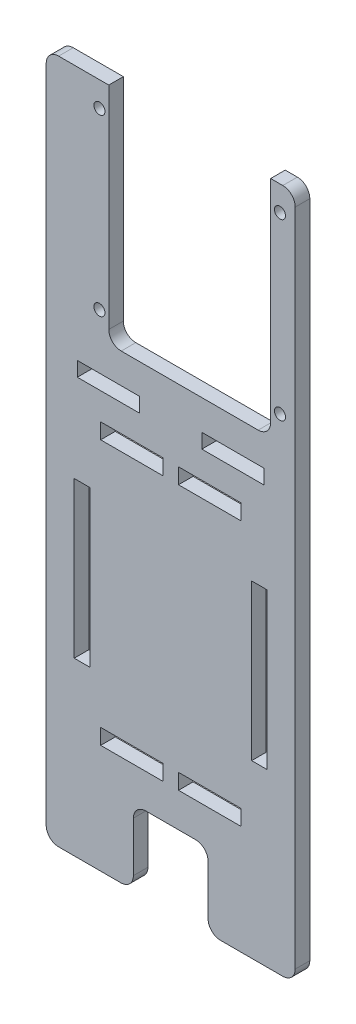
ISO-10303-21;
HEADER;
FILE_DESCRIPTION(('STEP AP214'),'2;1');
FILE_NAME('part.step','',(''),(''),'','','');
FILE_SCHEMA(('AUTOMOTIVE_DESIGN { 1 0 10303 214 1 1 1 1 }'));
ENDSEC;
DATA;
#1=APPLICATION_CONTEXT('core data for automotive mechanical design processes');
#2=APPLICATION_PROTOCOL_DEFINITION('international standard','automotive_design',2000,#1);
#3=PRODUCT_CONTEXT('',#1,'mechanical');
#4=PRODUCT('Part','Part','',(#3));
#5=PRODUCT_RELATED_PRODUCT_CATEGORY('part','',(#4));
#6=PRODUCT_DEFINITION_FORMATION('','',#4);
#7=PRODUCT_DEFINITION_CONTEXT('part definition',#1,'design');
#8=PRODUCT_DEFINITION('design','',#6,#7);
#9=PRODUCT_DEFINITION_SHAPE('','',#8);
#10=(LENGTH_UNIT() NAMED_UNIT(*) SI_UNIT(.MILLI.,.METRE.));
#11=(NAMED_UNIT(*) PLANE_ANGLE_UNIT() SI_UNIT($,.RADIAN.));
#12=(NAMED_UNIT(*) SI_UNIT($,.STERADIAN.) SOLID_ANGLE_UNIT());
#13=UNCERTAINTY_MEASURE_WITH_UNIT(LENGTH_MEASURE(1.E-05),#10,'distance_accuracy_value','');
#14=(GEOMETRIC_REPRESENTATION_CONTEXT(3) GLOBAL_UNCERTAINTY_ASSIGNED_CONTEXT((#13)) GLOBAL_UNIT_ASSIGNED_CONTEXT((#10,
#11,#12)) REPRESENTATION_CONTEXT('',''));
#15=CARTESIAN_POINT('',(0.,0.,0.));
#16=DIRECTION('',(0.,0.,1.));
#17=DIRECTION('',(1.,0.,0.));
#18=AXIS2_PLACEMENT_3D('',#15,#16,#17);
#19=CARTESIAN_POINT('',(-25.4,69.85,2.9718));
#20=DIRECTION('',(0.,-1.,0.));
#21=DIRECTION('',(0.,0.,-1.));
#22=AXIS2_PLACEMENT_3D('',#19,#20,#21);
#23=PLANE('',#22);
#24=DIRECTION('',(-1.,0.,0.));
#25=VECTOR('',#24,1.);
#26=CARTESIAN_POINT('',(-25.4,69.85,2.9718));
#27=LINE('',#26,#25);
#28=CARTESIAN_POINT('',(22.86,69.85,2.9718));
#29=VERTEX_POINT('',#28);
#30=CARTESIAN_POINT('',(20.3824993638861,69.85,2.9718));
#31=VERTEX_POINT('',#30);
#32=EDGE_CURVE('E829',#29,#31,#27,.T.);
#33=ORIENTED_EDGE('',*,*,#32,.F.);
#34=DIRECTION('',(0.,0.,-1.));
#35=VECTOR('',#34,1.);
#36=CARTESIAN_POINT('',(22.86,69.85,2.9718));
#37=LINE('',#36,#35);
#38=CARTESIAN_POINT('',(22.86,69.85,0.));
#39=VERTEX_POINT('',#38);
#40=EDGE_CURVE('E920',#29,#39,#37,.T.);
#41=ORIENTED_EDGE('',*,*,#40,.T.);
#42=DIRECTION('',(-1.,0.,0.));
#43=VECTOR('',#42,1.);
#44=CARTESIAN_POINT('',(-25.4,69.85,0.));
#45=LINE('',#44,#43);
#46=CARTESIAN_POINT('',(20.3824993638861,69.85,0.));
#47=VERTEX_POINT('',#46);
#48=EDGE_CURVE('E845',#39,#47,#45,.T.);
#49=ORIENTED_EDGE('',*,*,#48,.T.);
#50=DIRECTION('',(0.,0.,1.));
#51=VECTOR('',#50,1.);
#52=CARTESIAN_POINT('',(20.3824993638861,69.85,0.));
#53=LINE('',#52,#51);
#54=EDGE_CURVE('E785',#47,#31,#53,.T.);
#55=ORIENTED_EDGE('',*,*,#54,.T.);
#56=EDGE_LOOP('',(#33,#41,#49,#55));
#57=FACE_BOUND('',#56,.T.);
#58=ADVANCED_FACE('F41',(#57),#23,.F.);
#59=CARTESIAN_POINT('',(-25.4,-69.85,2.9718));
#60=DIRECTION('',(0.,1.,0.));
#61=DIRECTION('',(0.,0.,1.));
#62=AXIS2_PLACEMENT_3D('',#59,#60,#61);
#63=PLANE('',#62);
#64=DIRECTION('',(1.,0.,0.));
#65=VECTOR('',#64,1.);
#66=CARTESIAN_POINT('',(-25.4,-69.85,0.));
#67=LINE('',#66,#65);
#68=CARTESIAN_POINT('',(10.16,-69.85,0.));
#69=VERTEX_POINT('',#68);
#70=CARTESIAN_POINT('',(22.86,-69.85,0.));
#71=VERTEX_POINT('',#70);
#72=EDGE_CURVE('E852',#69,#71,#67,.T.);
#73=ORIENTED_EDGE('',*,*,#72,.T.);
#74=DIRECTION('',(0.,0.,-1.));
#75=VECTOR('',#74,1.);
#76=CARTESIAN_POINT('',(22.86,-69.85,2.9718));
#77=LINE('',#76,#75);
#78=CARTESIAN_POINT('',(22.86,-69.85,2.9718));
#79=VERTEX_POINT('',#78);
#80=EDGE_CURVE('E943',#71,#79,#77,.F.);
#81=ORIENTED_EDGE('',*,*,#80,.T.);
#82=DIRECTION('',(1.,0.,0.));
#83=VECTOR('',#82,1.);
#84=CARTESIAN_POINT('',(-25.4,-69.85,2.9718));
#85=LINE('',#84,#83);
#86=CARTESIAN_POINT('',(10.16,-69.85,2.9718));
#87=VERTEX_POINT('',#86);
#88=EDGE_CURVE('E836',#87,#79,#85,.T.);
#89=ORIENTED_EDGE('',*,*,#88,.F.);
#90=DIRECTION('',(0.,0.,-1.));
#91=VECTOR('',#90,1.);
#92=CARTESIAN_POINT('',(10.16,-69.85,2.9718));
#93=LINE('',#92,#91);
#94=EDGE_CURVE('E939',#87,#69,#93,.T.);
#95=ORIENTED_EDGE('',*,*,#94,.T.);
#96=EDGE_LOOP('',(#73,#81,#89,#95));
#97=FACE_BOUND('',#96,.T.);
#98=ADVANCED_FACE('F1087',(#97),#63,.F.);
#99=CARTESIAN_POINT('',(25.4,-69.85,2.9718));
#100=DIRECTION('',(-1.,0.,0.));
#101=DIRECTION('',(0.,0.,1.));
#102=AXIS2_PLACEMENT_3D('',#99,#100,#101);
#103=PLANE('',#102);
#104=DIRECTION('',(0.,1.,0.));
#105=VECTOR('',#104,1.);
#106=CARTESIAN_POINT('',(25.4,-69.85,0.));
#107=LINE('',#106,#105);
#108=CARTESIAN_POINT('',(25.4,-67.31,0.));
#109=VERTEX_POINT('',#108);
#110=CARTESIAN_POINT('',(25.4,67.31,0.));
#111=VERTEX_POINT('',#110);
#112=EDGE_CURVE('E812',#109,#111,#107,.T.);
#113=ORIENTED_EDGE('',*,*,#112,.T.);
#114=DIRECTION('',(0.,0.,-1.));
#115=VECTOR('',#114,1.);
#116=CARTESIAN_POINT('',(25.4,67.31,2.9718));
#117=LINE('',#116,#115);
#118=CARTESIAN_POINT('',(25.4,67.31,2.9718));
#119=VERTEX_POINT('',#118);
#120=EDGE_CURVE('E928',#111,#119,#117,.F.);
#121=ORIENTED_EDGE('',*,*,#120,.T.);
#122=DIRECTION('',(0.,1.,0.));
#123=VECTOR('',#122,1.);
#124=CARTESIAN_POINT('',(25.4,-69.85,2.9718));
#125=LINE('',#124,#123);
#126=CARTESIAN_POINT('',(25.4,-67.31,2.9718));
#127=VERTEX_POINT('',#126);
#128=EDGE_CURVE('E823',#127,#119,#125,.T.);
#129=ORIENTED_EDGE('',*,*,#128,.F.);
#130=DIRECTION('',(0.,0.,-1.));
#131=VECTOR('',#130,1.);
#132=CARTESIAN_POINT('',(25.4,-67.31,2.9718));
#133=LINE('',#132,#131);
#134=EDGE_CURVE('E924',#127,#109,#133,.T.);
#135=ORIENTED_EDGE('',*,*,#134,.T.);
#136=EDGE_LOOP('',(#113,#121,#129,#135));
#137=FACE_BOUND('',#136,.T.);
#138=ADVANCED_FACE('F1076',(#137),#103,.F.);
#139=CARTESIAN_POINT('',(-12.6375006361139,69.85,0.));
#140=VERTEX_POINT('',#139);
#141=CARTESIAN_POINT('',(-22.86,69.85,0.));
#142=VERTEX_POINT('',#141);
#143=EDGE_CURVE('E844',#140,#142,#45,.T.);
#144=ORIENTED_EDGE('',*,*,#143,.T.);
#145=DIRECTION('',(0.,0.,-1.));
#146=VECTOR('',#145,1.);
#147=CARTESIAN_POINT('',(-22.86,69.85,2.9718));
#148=LINE('',#147,#146);
#149=CARTESIAN_POINT('',(-22.86,69.85,2.9718));
#150=VERTEX_POINT('',#149);
#151=EDGE_CURVE('E899',#142,#150,#148,.F.);
#152=ORIENTED_EDGE('',*,*,#151,.T.);
#153=CARTESIAN_POINT('',(-12.6375006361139,69.85,2.9718));
#154=VERTEX_POINT('',#153);
#155=EDGE_CURVE('E827',#154,#150,#27,.T.);
#156=ORIENTED_EDGE('',*,*,#155,.F.);
#157=DIRECTION('',(0.,0.,1.));
#158=VECTOR('',#157,1.);
#159=CARTESIAN_POINT('',(-12.6375006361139,69.85,0.));
#160=LINE('',#159,#158);
#161=EDGE_CURVE('E796',#140,#154,#160,.T.);
#162=ORIENTED_EDGE('',*,*,#161,.F.);
#163=EDGE_LOOP('',(#144,#152,#156,#162));
#164=FACE_BOUND('',#163,.T.);
#165=ADVANCED_FACE('F1039',(#164),#23,.F.);
#166=CARTESIAN_POINT('',(-25.4,-69.85,2.9718));
#167=DIRECTION('',(1.,0.,0.));
#168=DIRECTION('',(0.,0.,-1.));
#169=AXIS2_PLACEMENT_3D('',#166,#167,#168);
#170=PLANE('',#169);
#171=DIRECTION('',(0.,-1.,0.));
#172=VECTOR('',#171,1.);
#173=CARTESIAN_POINT('',(-25.4,-69.85,2.9718));
#174=LINE('',#173,#172);
#175=CARTESIAN_POINT('',(-25.4,67.31,2.9718));
#176=VERTEX_POINT('',#175);
#177=CARTESIAN_POINT('',(-25.4,-67.31,2.9718));
#178=VERTEX_POINT('',#177);
#179=EDGE_CURVE('E832',#176,#178,#174,.T.);
#180=ORIENTED_EDGE('',*,*,#179,.F.);
#181=DIRECTION('',(0.,0.,-1.));
#182=VECTOR('',#181,1.);
#183=CARTESIAN_POINT('',(-25.4,67.31,2.9718));
#184=LINE('',#183,#182);
#185=CARTESIAN_POINT('',(-25.4,67.31,0.));
#186=VERTEX_POINT('',#185);
#187=EDGE_CURVE('E877',#176,#186,#184,.T.);
#188=ORIENTED_EDGE('',*,*,#187,.T.);
#189=DIRECTION('',(0.,-1.,0.));
#190=VECTOR('',#189,1.);
#191=CARTESIAN_POINT('',(-25.4,-69.85,0.));
#192=LINE('',#191,#190);
#193=CARTESIAN_POINT('',(-25.4,-67.31,0.));
#194=VERTEX_POINT('',#193);
#195=EDGE_CURVE('E848',#186,#194,#192,.T.);
#196=ORIENTED_EDGE('',*,*,#195,.T.);
#197=DIRECTION('',(0.,0.,-1.));
#198=VECTOR('',#197,1.);
#199=CARTESIAN_POINT('',(-25.4,-67.31,2.9718));
#200=LINE('',#199,#198);
#201=EDGE_CURVE('E874',#194,#178,#200,.F.);
#202=ORIENTED_EDGE('',*,*,#201,.T.);
#203=EDGE_LOOP('',(#180,#188,#196,#202));
#204=FACE_BOUND('',#203,.T.);
#205=ADVANCED_FACE('F1029',(#204),#170,.F.);
#206=CARTESIAN_POINT('',(-22.86,-69.85,2.9718));
#207=VERTEX_POINT('',#206);
#208=CARTESIAN_POINT('',(-10.16,-69.85,2.9718));
#209=VERTEX_POINT('',#208);
#210=EDGE_CURVE('E840',#207,#209,#85,.T.);
#211=ORIENTED_EDGE('',*,*,#210,.F.);
#212=DIRECTION('',(0.,0.,-1.));
#213=VECTOR('',#212,1.);
#214=CARTESIAN_POINT('',(-22.86,-69.85,2.9718));
#215=LINE('',#214,#213);
#216=CARTESIAN_POINT('',(-22.86,-69.85,0.));
#217=VERTEX_POINT('',#216);
#218=EDGE_CURVE('E935',#207,#217,#215,.T.);
#219=ORIENTED_EDGE('',*,*,#218,.T.);
#220=CARTESIAN_POINT('',(-10.16,-69.85,0.));
#221=VERTEX_POINT('',#220);
#222=EDGE_CURVE('E828',#217,#221,#67,.T.);
#223=ORIENTED_EDGE('',*,*,#222,.T.);
#224=DIRECTION('',(0.,0.,1.));
#225=VECTOR('',#224,1.);
#226=CARTESIAN_POINT('',(-10.16,-69.85,2.9718));
#227=LINE('',#226,#225);
#228=EDGE_CURVE('E931',#221,#209,#227,.T.);
#229=ORIENTED_EDGE('',*,*,#228,.T.);
#230=EDGE_LOOP('',(#211,#219,#223,#229));
#231=FACE_BOUND('',#230,.T.);
#232=ADVANCED_FACE('F1020',(#231),#63,.F.);
#233=CARTESIAN_POINT('',(0.,0.,2.9718));
#234=DIRECTION('',(0.,0.,-1.));
#235=DIRECTION('',(-1.,0.,0.));
#236=AXIS2_PLACEMENT_3D('',#233,#234,#235);
#237=PLANE('',#236);
#238=DIRECTION('',(-1.,0.,0.));
#239=VECTOR('',#238,1.);
#240=CARTESIAN_POINT('',(6.35,17.9959,2.9718));
#241=LINE('',#240,#239);
#242=CARTESIAN_POINT('',(19.05,17.9959,2.9718));
#243=VERTEX_POINT('',#242);
#244=CARTESIAN_POINT('',(6.35,17.9959,2.9718));
#245=VERTEX_POINT('',#244);
#246=EDGE_CURVE('E419',#243,#245,#241,.T.);
#247=ORIENTED_EDGE('',*,*,#246,.F.);
#248=DIRECTION('',(0.,1.,0.));
#249=VECTOR('',#248,1.);
#250=CARTESIAN_POINT('',(19.05,17.9959,2.9718));
#251=LINE('',#250,#249);
#252=CARTESIAN_POINT('',(19.05,15.0241,2.9718));
#253=VERTEX_POINT('',#252);
#254=EDGE_CURVE('E57',#253,#243,#251,.T.);
#255=ORIENTED_EDGE('',*,*,#254,.F.);
#256=DIRECTION('',(1.,0.,0.));
#257=VECTOR('',#256,1.);
#258=CARTESIAN_POINT('',(6.35,15.0241,2.9718));
#259=LINE('',#258,#257);
#260=CARTESIAN_POINT('',(6.35,15.0241,2.9718));
#261=VERTEX_POINT('',#260);
#262=EDGE_CURVE('E406',#261,#253,#259,.T.);
#263=ORIENTED_EDGE('',*,*,#262,.F.);
#264=DIRECTION('',(0.,-1.,0.));
#265=VECTOR('',#264,1.);
#266=CARTESIAN_POINT('',(6.35,17.9959,2.9718));
#267=LINE('',#266,#265);
#268=EDGE_CURVE('E410',#245,#261,#267,.T.);
#269=ORIENTED_EDGE('',*,*,#268,.F.);
#270=EDGE_LOOP('',(#247,#255,#263,#269));
#271=FACE_BOUND('',#270,.T.);
#272=DIRECTION('',(-1.,0.,0.));
#273=VECTOR('',#272,1.);
#274=CARTESIAN_POINT('',(-6.35,17.9959,2.9718));
#275=LINE('',#274,#273);
#276=CARTESIAN_POINT('',(-6.35,17.9959,2.9718));
#277=VERTEX_POINT('',#276);
#278=CARTESIAN_POINT('',(-19.05,17.9959,2.9718));
#279=VERTEX_POINT('',#278);
#280=EDGE_CURVE('E455',#277,#279,#275,.T.);
#281=ORIENTED_EDGE('',*,*,#280,.F.);
#282=DIRECTION('',(0.,1.,0.));
#283=VECTOR('',#282,1.);
#284=CARTESIAN_POINT('',(-6.35,17.9959,2.9718));
#285=LINE('',#284,#283);
#286=CARTESIAN_POINT('',(-6.35,15.0241,2.9718));
#287=VERTEX_POINT('',#286);
#288=EDGE_CURVE('E65',#287,#277,#285,.T.);
#289=ORIENTED_EDGE('',*,*,#288,.F.);
#290=DIRECTION('',(1.,0.,0.));
#291=VECTOR('',#290,1.);
#292=CARTESIAN_POINT('',(-6.35,15.0241,2.9718));
#293=LINE('',#292,#291);
#294=CARTESIAN_POINT('',(-19.05,15.0241,2.9718));
#295=VERTEX_POINT('',#294);
#296=EDGE_CURVE('E440',#295,#287,#293,.T.);
#297=ORIENTED_EDGE('',*,*,#296,.F.);
#298=DIRECTION('',(0.,-1.,0.));
#299=VECTOR('',#298,1.);
#300=CARTESIAN_POINT('',(-19.05,17.9959,2.9718));
#301=LINE('',#300,#299);
#302=EDGE_CURVE('E459',#279,#295,#301,.T.);
#303=ORIENTED_EDGE('',*,*,#302,.F.);
#304=EDGE_LOOP('',(#281,#289,#297,#303));
#305=FACE_BOUND('',#304,.T.);
#306=DIRECTION('',(-1.,0.,0.));
#307=VECTOR('',#306,1.);
#308=CARTESIAN_POINT('',(16.51,-3.17500000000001,2.9718));
#309=LINE('',#308,#307);
#310=CARTESIAN_POINT('',(19.685,-3.17500000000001,2.9718));
#311=VERTEX_POINT('',#310);
#312=CARTESIAN_POINT('',(16.51,-3.17500000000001,2.9718));
#313=VERTEX_POINT('',#312);
#314=EDGE_CURVE('E497',#311,#313,#309,.T.);
#315=ORIENTED_EDGE('',*,*,#314,.F.);
#316=DIRECTION('',(0.,1.,0.));
#317=VECTOR('',#316,1.);
#318=CARTESIAN_POINT('',(19.685,-3.17500000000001,2.9718));
#319=LINE('',#318,#317);
#320=CARTESIAN_POINT('',(19.685,-34.925,2.9718));
#321=VERTEX_POINT('',#320);
#322=EDGE_CURVE('E494',#321,#311,#319,.T.);
#323=ORIENTED_EDGE('',*,*,#322,.F.);
#324=DIRECTION('',(1.,0.,0.));
#325=VECTOR('',#324,1.);
#326=CARTESIAN_POINT('',(16.51,-34.925,2.9718));
#327=LINE('',#326,#325);
#328=CARTESIAN_POINT('',(16.51,-34.925,2.9718));
#329=VERTEX_POINT('',#328);
#330=EDGE_CURVE('E481',#329,#321,#327,.T.);
#331=ORIENTED_EDGE('',*,*,#330,.F.);
#332=DIRECTION('',(0.,-1.,0.));
#333=VECTOR('',#332,1.);
#334=CARTESIAN_POINT('',(16.51,-3.17500000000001,2.9718));
#335=LINE('',#334,#333);
#336=EDGE_CURVE('E502',#313,#329,#335,.T.);
#337=ORIENTED_EDGE('',*,*,#336,.F.);
#338=EDGE_LOOP('',(#315,#323,#331,#337));
#339=FACE_BOUND('',#338,.T.);
#340=DIRECTION('',(1.,0.,0.));
#341=VECTOR('',#340,1.);
#342=CARTESIAN_POINT('',(1.5875,6.35000000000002,2.9718));
#343=LINE('',#342,#341);
#344=CARTESIAN_POINT('',(1.5875,6.35000000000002,2.9718));
#345=VERTEX_POINT('',#344);
#346=CARTESIAN_POINT('',(14.2875,6.35000000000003,2.9718));
#347=VERTEX_POINT('',#346);
#348=EDGE_CURVE('E542',#345,#347,#343,.T.);
#349=ORIENTED_EDGE('',*,*,#348,.F.);
#350=DIRECTION('',(0.,-1.,0.));
#351=VECTOR('',#350,1.);
#352=CARTESIAN_POINT('',(1.5875,6.35000000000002,2.9718));
#353=LINE('',#352,#351);
#354=CARTESIAN_POINT('',(1.58749999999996,9.52500000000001,2.9718));
#355=VERTEX_POINT('',#354);
#356=EDGE_CURVE('E429',#355,#345,#353,.T.);
#357=ORIENTED_EDGE('',*,*,#356,.F.);
#358=DIRECTION('',(-1.,0.,0.));
#359=VECTOR('',#358,1.);
#360=CARTESIAN_POINT('',(1.58749999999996,9.52500000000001,2.9718));
#361=LINE('',#360,#359);
#362=CARTESIAN_POINT('',(14.2875,9.52500000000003,2.9718));
#363=VERTEX_POINT('',#362);
#364=EDGE_CURVE('E527',#363,#355,#361,.T.);
#365=ORIENTED_EDGE('',*,*,#364,.F.);
#366=DIRECTION('',(0.,1.,0.));
#367=VECTOR('',#366,1.);
#368=CARTESIAN_POINT('',(14.2875,6.35000000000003,2.9718));
#369=LINE('',#368,#367);
#370=EDGE_CURVE('E546',#347,#363,#369,.T.);
#371=ORIENTED_EDGE('',*,*,#370,.F.);
#372=EDGE_LOOP('',(#349,#357,#365,#371));
#373=FACE_BOUND('',#372,.T.);
#374=DIRECTION('',(-1.,0.,0.));
#375=VECTOR('',#374,1.);
#376=CARTESIAN_POINT('',(1.58749999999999,-44.45,2.9718));
#377=LINE('',#376,#375);
#378=CARTESIAN_POINT('',(14.2875,-44.45,2.9718));
#379=VERTEX_POINT('',#378);
#380=CARTESIAN_POINT('',(1.58749999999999,-44.45,2.9718));
#381=VERTEX_POINT('',#380);
#382=EDGE_CURVE('E675',#379,#381,#377,.T.);
#383=ORIENTED_EDGE('',*,*,#382,.F.);
#384=DIRECTION('',(0.,1.,0.));
#385=VECTOR('',#384,1.);
#386=CARTESIAN_POINT('',(14.2875,-44.45,2.9718));
#387=LINE('',#386,#385);
#388=CARTESIAN_POINT('',(14.2875,-47.625,2.9718));
#389=VERTEX_POINT('',#388);
#390=EDGE_CURVE('E672',#389,#379,#387,.T.);
#391=ORIENTED_EDGE('',*,*,#390,.F.);
#392=DIRECTION('',(1.,0.,0.));
#393=VECTOR('',#392,1.);
#394=CARTESIAN_POINT('',(1.58749999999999,-47.625,2.9718));
#395=LINE('',#394,#393);
#396=CARTESIAN_POINT('',(1.58749999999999,-47.625,2.9718));
#397=VERTEX_POINT('',#396);
#398=EDGE_CURVE('E659',#397,#389,#395,.T.);
#399=ORIENTED_EDGE('',*,*,#398,.F.);
#400=DIRECTION('',(0.,-1.,0.));
#401=VECTOR('',#400,1.);
#402=CARTESIAN_POINT('',(1.58749999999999,-44.45,2.9718));
#403=LINE('',#402,#401);
#404=EDGE_CURVE('E680',#381,#397,#403,.T.);
#405=ORIENTED_EDGE('',*,*,#404,.F.);
#406=EDGE_LOOP('',(#383,#391,#399,#405));
#407=FACE_BOUND('',#406,.T.);
#408=DIRECTION('',(-1.,0.,0.));
#409=VECTOR('',#408,1.);
#410=CARTESIAN_POINT('',(-16.51,-3.17500000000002,2.9718));
#411=LINE('',#410,#409);
#412=CARTESIAN_POINT('',(-16.51,-3.17500000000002,2.9718));
#413=VERTEX_POINT('',#412);
#414=CARTESIAN_POINT('',(-19.685,-3.17500000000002,2.9718));
#415=VERTEX_POINT('',#414);
#416=EDGE_CURVE('E718',#413,#415,#411,.T.);
#417=ORIENTED_EDGE('',*,*,#416,.F.);
#418=DIRECTION('',(0.,1.,0.));
#419=VECTOR('',#418,1.);
#420=CARTESIAN_POINT('',(-16.51,-3.17500000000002,2.9718));
#421=LINE('',#420,#419);
#422=CARTESIAN_POINT('',(-16.51,-34.925,2.9718));
#423=VERTEX_POINT('',#422);
#424=EDGE_CURVE('E602',#423,#413,#421,.T.);
#425=ORIENTED_EDGE('',*,*,#424,.F.);
#426=DIRECTION('',(1.,0.,0.));
#427=VECTOR('',#426,1.);
#428=CARTESIAN_POINT('',(-16.51,-34.925,2.9718));
#429=LINE('',#428,#427);
#430=CARTESIAN_POINT('',(-19.685,-34.925,2.9718));
#431=VERTEX_POINT('',#430);
#432=EDGE_CURVE('E703',#431,#423,#429,.T.);
#433=ORIENTED_EDGE('',*,*,#432,.F.);
#434=DIRECTION('',(0.,-1.,0.));
#435=VECTOR('',#434,1.);
#436=CARTESIAN_POINT('',(-19.685,-3.17500000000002,2.9718));
#437=LINE('',#436,#435);
#438=EDGE_CURVE('E722',#415,#431,#437,.T.);
#439=ORIENTED_EDGE('',*,*,#438,.F.);
#440=EDGE_LOOP('',(#417,#425,#433,#439));
#441=FACE_BOUND('',#440,.T.);
#442=DIRECTION('',(-1.,0.,0.));
#443=VECTOR('',#442,1.);
#444=CARTESIAN_POINT('',(-1.58749999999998,-44.45,2.9718));
#445=LINE('',#444,#443);
#446=CARTESIAN_POINT('',(-1.58749999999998,-44.45,2.9718));
#447=VERTEX_POINT('',#446);
#448=CARTESIAN_POINT('',(-14.2875,-44.45,2.9718));
#449=VERTEX_POINT('',#448);
#450=EDGE_CURVE('E587',#447,#449,#445,.T.);
#451=ORIENTED_EDGE('',*,*,#450,.F.);
#452=DIRECTION('',(0.,1.,0.));
#453=VECTOR('',#452,1.);
#454=CARTESIAN_POINT('',(-1.58749999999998,-44.45,2.9718));
#455=LINE('',#454,#453);
#456=CARTESIAN_POINT('',(-1.58749999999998,-47.625,2.9718));
#457=VERTEX_POINT('',#456);
#458=EDGE_CURVE('E584',#457,#447,#455,.T.);
#459=ORIENTED_EDGE('',*,*,#458,.F.);
#460=DIRECTION('',(1.,0.,0.));
#461=VECTOR('',#460,1.);
#462=CARTESIAN_POINT('',(-1.58749999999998,-47.625,2.9718));
#463=LINE('',#462,#461);
#464=CARTESIAN_POINT('',(-14.2875,-47.625,2.9718));
#465=VERTEX_POINT('',#464);
#466=EDGE_CURVE('E571',#465,#457,#463,.T.);
#467=ORIENTED_EDGE('',*,*,#466,.F.);
#468=DIRECTION('',(0.,-1.,0.));
#469=VECTOR('',#468,1.);
#470=CARTESIAN_POINT('',(-14.2875,-44.45,2.9718));
#471=LINE('',#470,#469);
#472=EDGE_CURVE('E592',#449,#465,#471,.T.);
#473=ORIENTED_EDGE('',*,*,#472,.F.);
#474=EDGE_LOOP('',(#451,#459,#467,#473));
#475=FACE_BOUND('',#474,.T.);
#476=DIRECTION('',(-1.,0.,0.));
#477=VECTOR('',#476,1.);
#478=CARTESIAN_POINT('',(-1.58749999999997,9.52500000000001,2.9718));
#479=LINE('',#478,#477);
#480=CARTESIAN_POINT('',(-1.58749999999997,9.52500000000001,2.9718));
#481=VERTEX_POINT('',#480);
#482=CARTESIAN_POINT('',(-14.2875,9.52500000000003,2.9718));
#483=VERTEX_POINT('',#482);
#484=EDGE_CURVE('E632',#481,#483,#479,.T.);
#485=ORIENTED_EDGE('',*,*,#484,.F.);
#486=DIRECTION('',(0.,1.,0.));
#487=VECTOR('',#486,1.);
#488=CARTESIAN_POINT('',(-1.5875,6.35000000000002,2.9718));
#489=LINE('',#488,#487);
#490=CARTESIAN_POINT('',(-1.5875,6.35000000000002,2.9718));
#491=VERTEX_POINT('',#490);
#492=EDGE_CURVE('E556',#491,#481,#489,.T.);
#493=ORIENTED_EDGE('',*,*,#492,.F.);
#494=DIRECTION('',(1.,0.,0.));
#495=VECTOR('',#494,1.);
#496=CARTESIAN_POINT('',(-1.5875,6.35000000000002,2.9718));
#497=LINE('',#496,#495);
#498=CARTESIAN_POINT('',(-14.2875,6.35000000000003,2.9718));
#499=VERTEX_POINT('',#498);
#500=EDGE_CURVE('E617',#499,#491,#497,.T.);
#501=ORIENTED_EDGE('',*,*,#500,.F.);
#502=DIRECTION('',(0.,-1.,0.));
#503=VECTOR('',#502,1.);
#504=CARTESIAN_POINT('',(-14.2875,6.35000000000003,2.9718));
#505=LINE('',#504,#503);
#506=EDGE_CURVE('E636',#483,#499,#505,.T.);
#507=ORIENTED_EDGE('',*,*,#506,.F.);
#508=EDGE_LOOP('',(#485,#493,#501,#507));
#509=FACE_BOUND('',#508,.T.);
#510=CARTESIAN_POINT('',(-14.5425006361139,64.77,2.9718));
#511=DIRECTION('',(0.,0.,1.));
#512=DIRECTION('',(1.,0.,0.));
#513=AXIS2_PLACEMENT_3D('',#510,#511,#512);
#514=CIRCLE('',#513,1.13029999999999);
#515=CARTESIAN_POINT('',(-13.412200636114,64.77,2.9718));
#516=VERTEX_POINT('',#515);
#517=EDGE_CURVE('E512',#516,#516,#514,.T.);
#518=ORIENTED_EDGE('',*,*,#517,.F.);
#519=EDGE_LOOP('',(#518));
#520=FACE_BOUND('',#519,.T.);
#521=CARTESIAN_POINT('',(-14.5425006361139,29.21,2.9718));
#522=DIRECTION('',(0.,0.,1.));
#523=DIRECTION('',(1.,0.,0.));
#524=AXIS2_PLACEMENT_3D('',#521,#522,#523);
#525=CIRCLE('',#524,1.13029999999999);
#526=CARTESIAN_POINT('',(-13.412200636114,29.21,2.9718));
#527=VERTEX_POINT('',#526);
#528=EDGE_CURVE('E747',#527,#527,#525,.T.);
#529=ORIENTED_EDGE('',*,*,#528,.F.);
#530=EDGE_LOOP('',(#529));
#531=FACE_BOUND('',#530,.T.);
#532=CARTESIAN_POINT('',(22.2874993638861,64.77,2.9718));
#533=DIRECTION('',(0.,0.,1.));
#534=DIRECTION('',(1.,0.,0.));
#535=AXIS2_PLACEMENT_3D('',#532,#533,#534);
#536=CIRCLE('',#535,1.13029999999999);
#537=CARTESIAN_POINT('',(23.4177993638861,64.77,2.9718));
#538=VERTEX_POINT('',#537);
#539=EDGE_CURVE('E755',#538,#538,#536,.T.);
#540=ORIENTED_EDGE('',*,*,#539,.F.);
#541=EDGE_LOOP('',(#540));
#542=FACE_BOUND('',#541,.T.);
#543=CARTESIAN_POINT('',(22.2874993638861,29.21,2.9718));
#544=DIRECTION('',(0.,0.,1.));
#545=DIRECTION('',(1.,0.,0.));
#546=AXIS2_PLACEMENT_3D('',#543,#544,#545);
#547=CIRCLE('',#546,1.13029999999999);
#548=CARTESIAN_POINT('',(23.4177993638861,29.21,2.9718));
#549=VERTEX_POINT('',#548);
#550=EDGE_CURVE('E763',#549,#549,#547,.T.);
#551=ORIENTED_EDGE('',*,*,#550,.F.);
#552=EDGE_LOOP('',(#551));
#553=FACE_BOUND('',#552,.T.);
#554=ORIENTED_EDGE('',*,*,#155,.T.);
#555=CARTESIAN_POINT('',(-22.86,67.31,2.9718));
#556=DIRECTION('',(0.,0.,-1.));
#557=DIRECTION('',(-1.,0.,0.));
#558=AXIS2_PLACEMENT_3D('',#555,#556,#557);
#559=CIRCLE('',#558,2.54);
#560=EDGE_CURVE('E917',#150,#176,#559,.F.);
#561=ORIENTED_EDGE('',*,*,#560,.T.);
#562=ORIENTED_EDGE('',*,*,#179,.T.);
#563=CARTESIAN_POINT('',(-22.86,-67.31,2.9718));
#564=DIRECTION('',(0.,0.,-1.));
#565=DIRECTION('',(-1.,0.,0.));
#566=AXIS2_PLACEMENT_3D('',#563,#564,#565);
#567=CIRCLE('',#566,2.54);
#568=EDGE_CURVE('E911',#178,#207,#567,.F.);
#569=ORIENTED_EDGE('',*,*,#568,.T.);
#570=ORIENTED_EDGE('',*,*,#210,.T.);
#571=CARTESIAN_POINT('',(-10.16,-67.31,2.9718));
#572=DIRECTION('',(0.,0.,-1.));
#573=DIRECTION('',(-1.,0.,0.));
#574=AXIS2_PLACEMENT_3D('',#571,#572,#573);
#575=CIRCLE('',#574,2.54);
#576=CARTESIAN_POINT('',(-7.61999999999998,-67.31,2.9718));
#577=VERTEX_POINT('',#576);
#578=EDGE_CURVE('E905',#209,#577,#575,.F.);
#579=ORIENTED_EDGE('',*,*,#578,.T.);
#580=DIRECTION('',(0.,-1.,0.));
#581=VECTOR('',#580,1.);
#582=CARTESIAN_POINT('',(-7.61999999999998,-54.61,2.9718));
#583=LINE('',#582,#581);
#584=CARTESIAN_POINT('',(-7.61999999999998,-57.15,2.9718));
#585=VERTEX_POINT('',#584);
#586=EDGE_CURVE('E808',#585,#577,#583,.T.);
#587=ORIENTED_EDGE('',*,*,#586,.F.);
#588=CARTESIAN_POINT('',(-5.07999999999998,-57.15,2.9718));
#589=DIRECTION('',(0.,0.,-1.));
#590=DIRECTION('',(-1.,0.,0.));
#591=AXIS2_PLACEMENT_3D('',#588,#589,#590);
#592=CIRCLE('',#591,2.54);
#593=CARTESIAN_POINT('',(-5.07999999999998,-54.61,2.9718));
#594=VERTEX_POINT('',#593);
#595=EDGE_CURVE('E978',#585,#594,#592,.T.);
#596=ORIENTED_EDGE('',*,*,#595,.T.);
#597=DIRECTION('',(-1.,0.,0.));
#598=VECTOR('',#597,1.);
#599=CARTESIAN_POINT('',(-7.61999999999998,-54.61,2.9718));
#600=LINE('',#599,#598);
#601=CARTESIAN_POINT('',(5.08000000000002,-54.61,2.9718));
#602=VERTEX_POINT('',#601);
#603=EDGE_CURVE('E816',#602,#594,#600,.T.);
#604=ORIENTED_EDGE('',*,*,#603,.F.);
#605=CARTESIAN_POINT('',(5.08000000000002,-57.15,2.9718));
#606=DIRECTION('',(0.,0.,-1.));
#607=DIRECTION('',(-1.,0.,0.));
#608=AXIS2_PLACEMENT_3D('',#605,#606,#607);
#609=CIRCLE('',#608,2.54);
#610=CARTESIAN_POINT('',(7.62000000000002,-57.15,2.9718));
#611=VERTEX_POINT('',#610);
#612=EDGE_CURVE('E50',#602,#611,#609,.T.);
#613=ORIENTED_EDGE('',*,*,#612,.T.);
#614=DIRECTION('',(0.,1.,0.));
#615=VECTOR('',#614,1.);
#616=CARTESIAN_POINT('',(7.62000000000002,-54.61,2.9718));
#617=LINE('',#616,#615);
#618=CARTESIAN_POINT('',(7.62000000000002,-67.31,2.9718));
#619=VERTEX_POINT('',#618);
#620=EDGE_CURVE('E799',#619,#611,#617,.T.);
#621=ORIENTED_EDGE('',*,*,#620,.F.);
#622=CARTESIAN_POINT('',(10.16,-67.31,2.9718));
#623=DIRECTION('',(0.,0.,-1.));
#624=DIRECTION('',(-1.,0.,0.));
#625=AXIS2_PLACEMENT_3D('',#622,#623,#624);
#626=CIRCLE('',#625,2.54);
#627=EDGE_CURVE('E902',#619,#87,#626,.F.);
#628=ORIENTED_EDGE('',*,*,#627,.T.);
#629=ORIENTED_EDGE('',*,*,#88,.T.);
#630=CARTESIAN_POINT('',(22.86,-67.31,2.9718));
#631=DIRECTION('',(0.,0.,-1.));
#632=DIRECTION('',(-1.,0.,0.));
#633=AXIS2_PLACEMENT_3D('',#630,#631,#632);
#634=CIRCLE('',#633,2.54);
#635=EDGE_CURVE('E908',#79,#127,#634,.F.);
#636=ORIENTED_EDGE('',*,*,#635,.T.);
#637=ORIENTED_EDGE('',*,*,#128,.T.);
#638=CARTESIAN_POINT('',(22.86,67.31,2.9718));
#639=DIRECTION('',(0.,0.,-1.));
#640=DIRECTION('',(-1.,0.,0.));
#641=AXIS2_PLACEMENT_3D('',#638,#639,#640);
#642=CIRCLE('',#641,2.54);
#643=EDGE_CURVE('E914',#119,#29,#642,.F.);
#644=ORIENTED_EDGE('',*,*,#643,.T.);
#645=ORIENTED_EDGE('',*,*,#32,.T.);
#646=DIRECTION('',(0.,1.,0.));
#647=VECTOR('',#646,1.);
#648=CARTESIAN_POINT('',(20.3824993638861,69.85,2.9718));
#649=LINE('',#648,#647);
#650=CARTESIAN_POINT('',(20.3824993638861,26.67,2.9718));
#651=VERTEX_POINT('',#650);
#652=EDGE_CURVE('E771',#651,#31,#649,.T.);
#653=ORIENTED_EDGE('',*,*,#652,.F.);
#654=CARTESIAN_POINT('',(17.8424993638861,26.67,2.9718));
#655=DIRECTION('',(0.,0.,-1.));
#656=DIRECTION('',(-1.,0.,0.));
#657=AXIS2_PLACEMENT_3D('',#654,#655,#656);
#658=CIRCLE('',#657,2.54);
#659=CARTESIAN_POINT('',(17.8424993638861,24.13,2.9718));
#660=VERTEX_POINT('',#659);
#661=EDGE_CURVE('E966',#651,#660,#658,.T.);
#662=ORIENTED_EDGE('',*,*,#661,.T.);
#663=DIRECTION('',(1.,0.,0.));
#664=VECTOR('',#663,1.);
#665=CARTESIAN_POINT('',(-12.6375006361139,24.13,2.9718));
#666=LINE('',#665,#664);
#667=CARTESIAN_POINT('',(-10.0975006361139,24.13,2.9718));
#668=VERTEX_POINT('',#667);
#669=EDGE_CURVE('E777',#668,#660,#666,.T.);
#670=ORIENTED_EDGE('',*,*,#669,.F.);
#671=CARTESIAN_POINT('',(-10.0975006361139,26.67,2.9718));
#672=DIRECTION('',(0.,0.,-1.));
#673=DIRECTION('',(-1.,0.,0.));
#674=AXIS2_PLACEMENT_3D('',#671,#672,#673);
#675=CIRCLE('',#674,2.54);
#676=CARTESIAN_POINT('',(-12.6375006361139,26.67,2.9718));
#677=VERTEX_POINT('',#676);
#678=EDGE_CURVE('E972',#668,#677,#675,.T.);
#679=ORIENTED_EDGE('',*,*,#678,.T.);
#680=DIRECTION('',(0.,-1.,0.));
#681=VECTOR('',#680,1.);
#682=CARTESIAN_POINT('',(-12.6375006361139,69.85,2.9718));
#683=LINE('',#682,#681);
#684=EDGE_CURVE('E789',#154,#677,#683,.T.);
#685=ORIENTED_EDGE('',*,*,#684,.F.);
#686=EDGE_LOOP('',(#554,#561,#562,#569,#570,#579,#587,#596,#604,#613,#621,#628,#629,#636,#637,
#644,#645,#653,#662,#670,#679,#685));
#687=FACE_BOUND('',#686,.T.);
#688=ADVANCED_FACE('F988',(#271,#305,#339,#373,#407,#441,#475,#509,#520,#531,#542,#553,#687),
#237,.F.);
#689=CARTESIAN_POINT('',(0.,0.,0.));
#690=DIRECTION('',(0.,0.,-1.));
#691=DIRECTION('',(-1.,0.,0.));
#692=AXIS2_PLACEMENT_3D('',#689,#690,#691);
#693=PLANE('',#692);
#694=DIRECTION('',(0.,1.,0.));
#695=VECTOR('',#694,1.);
#696=CARTESIAN_POINT('',(19.05,17.9959,0.));
#697=LINE('',#696,#695);
#698=CARTESIAN_POINT('',(19.05,15.0241,0.));
#699=VERTEX_POINT('',#698);
#700=CARTESIAN_POINT('',(19.05,17.9959,0.));
#701=VERTEX_POINT('',#700);
#702=EDGE_CURVE('E384',#699,#701,#697,.T.);
#703=ORIENTED_EDGE('',*,*,#702,.T.);
#704=DIRECTION('',(-1.,0.,0.));
#705=VECTOR('',#704,1.);
#706=CARTESIAN_POINT('',(6.35,17.9959,0.));
#707=LINE('',#706,#705);
#708=CARTESIAN_POINT('',(6.35,17.9959,0.));
#709=VERTEX_POINT('',#708);
#710=EDGE_CURVE('E395',#701,#709,#707,.T.);
#711=ORIENTED_EDGE('',*,*,#710,.T.);
#712=DIRECTION('',(0.,-1.,0.));
#713=VECTOR('',#712,1.);
#714=CARTESIAN_POINT('',(6.35,17.9959,0.));
#715=LINE('',#714,#713);
#716=CARTESIAN_POINT('',(6.35,15.0241,0.));
#717=VERTEX_POINT('',#716);
#718=EDGE_CURVE('E400',#709,#717,#715,.T.);
#719=ORIENTED_EDGE('',*,*,#718,.T.);
#720=DIRECTION('',(1.,0.,0.));
#721=VECTOR('',#720,1.);
#722=CARTESIAN_POINT('',(6.35,15.0241,0.));
#723=LINE('',#722,#721);
#724=EDGE_CURVE('E391',#717,#699,#723,.T.);
#725=ORIENTED_EDGE('',*,*,#724,.T.);
#726=EDGE_LOOP('',(#703,#711,#719,#725));
#727=FACE_BOUND('',#726,.T.);
#728=DIRECTION('',(0.,1.,0.));
#729=VECTOR('',#728,1.);
#730=CARTESIAN_POINT('',(-6.35,17.9959,0.));
#731=LINE('',#730,#729);
#732=CARTESIAN_POINT('',(-6.35,15.0241,0.));
#733=VERTEX_POINT('',#732);
#734=CARTESIAN_POINT('',(-6.35,17.9959,0.));
#735=VERTEX_POINT('',#734);
#736=EDGE_CURVE('E435',#733,#735,#731,.T.);
#737=ORIENTED_EDGE('',*,*,#736,.T.);
#738=DIRECTION('',(-1.,0.,0.));
#739=VECTOR('',#738,1.);
#740=CARTESIAN_POINT('',(-6.35,17.9959,0.));
#741=LINE('',#740,#739);
#742=CARTESIAN_POINT('',(-19.05,17.9959,0.));
#743=VERTEX_POINT('',#742);
#744=EDGE_CURVE('E439',#735,#743,#741,.T.);
#745=ORIENTED_EDGE('',*,*,#744,.T.);
#746=DIRECTION('',(0.,-1.,0.));
#747=VECTOR('',#746,1.);
#748=CARTESIAN_POINT('',(-19.05,17.9959,0.));
#749=LINE('',#748,#747);
#750=CARTESIAN_POINT('',(-19.05,15.0241,0.));
#751=VERTEX_POINT('',#750);
#752=EDGE_CURVE('E444',#743,#751,#749,.T.);
#753=ORIENTED_EDGE('',*,*,#752,.T.);
#754=DIRECTION('',(1.,0.,0.));
#755=VECTOR('',#754,1.);
#756=CARTESIAN_POINT('',(-6.35,15.0241,0.));
#757=LINE('',#756,#755);
#758=EDGE_CURVE('E448',#751,#733,#757,.T.);
#759=ORIENTED_EDGE('',*,*,#758,.T.);
#760=EDGE_LOOP('',(#737,#745,#753,#759));
#761=FACE_BOUND('',#760,.T.);
#762=DIRECTION('',(0.,1.,0.));
#763=VECTOR('',#762,1.);
#764=CARTESIAN_POINT('',(19.685,-3.17500000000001,0.));
#765=LINE('',#764,#763);
#766=CARTESIAN_POINT('',(19.685,-34.925,0.));
#767=VERTEX_POINT('',#766);
#768=CARTESIAN_POINT('',(19.685,-3.17500000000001,0.));
#769=VERTEX_POINT('',#768);
#770=EDGE_CURVE('E476',#767,#769,#765,.T.);
#771=ORIENTED_EDGE('',*,*,#770,.T.);
#772=DIRECTION('',(-1.,0.,0.));
#773=VECTOR('',#772,1.);
#774=CARTESIAN_POINT('',(16.51,-3.17500000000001,0.));
#775=LINE('',#774,#773);
#776=CARTESIAN_POINT('',(16.51,-3.17500000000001,0.));
#777=VERTEX_POINT('',#776);
#778=EDGE_CURVE('E480',#769,#777,#775,.T.);
#779=ORIENTED_EDGE('',*,*,#778,.T.);
#780=DIRECTION('',(0.,-1.,0.));
#781=VECTOR('',#780,1.);
#782=CARTESIAN_POINT('',(16.51,-3.17500000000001,0.));
#783=LINE('',#782,#781);
#784=CARTESIAN_POINT('',(16.51,-34.925,0.));
#785=VERTEX_POINT('',#784);
#786=EDGE_CURVE('E485',#777,#785,#783,.T.);
#787=ORIENTED_EDGE('',*,*,#786,.T.);
#788=DIRECTION('',(1.,0.,0.));
#789=VECTOR('',#788,1.);
#790=CARTESIAN_POINT('',(16.51,-34.925,0.));
#791=LINE('',#790,#789);
#792=EDGE_CURVE('E489',#785,#767,#791,.T.);
#793=ORIENTED_EDGE('',*,*,#792,.T.);
#794=EDGE_LOOP('',(#771,#779,#787,#793));
#795=FACE_BOUND('',#794,.T.);
#796=DIRECTION('',(0.,-1.,0.));
#797=VECTOR('',#796,1.);
#798=CARTESIAN_POINT('',(1.5875,6.35000000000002,0.));
#799=LINE('',#798,#797);
#800=CARTESIAN_POINT('',(1.58749999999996,9.52500000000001,0.));
#801=VERTEX_POINT('',#800);
#802=CARTESIAN_POINT('',(1.5875,6.35000000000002,0.));
#803=VERTEX_POINT('',#802);
#804=EDGE_CURVE('E522',#801,#803,#799,.T.);
#805=ORIENTED_EDGE('',*,*,#804,.T.);
#806=DIRECTION('',(1.,0.,0.));
#807=VECTOR('',#806,1.);
#808=CARTESIAN_POINT('',(1.5875,6.35000000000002,0.));
#809=LINE('',#808,#807);
#810=CARTESIAN_POINT('',(14.2875,6.35000000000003,0.));
#811=VERTEX_POINT('',#810);
#812=EDGE_CURVE('E526',#803,#811,#809,.T.);
#813=ORIENTED_EDGE('',*,*,#812,.T.);
#814=DIRECTION('',(0.,1.,0.));
#815=VECTOR('',#814,1.);
#816=CARTESIAN_POINT('',(14.2875,6.35000000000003,0.));
#817=LINE('',#816,#815);
#818=CARTESIAN_POINT('',(14.2875,9.52500000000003,0.));
#819=VERTEX_POINT('',#818);
#820=EDGE_CURVE('E531',#811,#819,#817,.T.);
#821=ORIENTED_EDGE('',*,*,#820,.T.);
#822=DIRECTION('',(-1.,0.,0.));
#823=VECTOR('',#822,1.);
#824=CARTESIAN_POINT('',(1.58749999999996,9.52500000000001,0.));
#825=LINE('',#824,#823);
#826=EDGE_CURVE('E535',#819,#801,#825,.T.);
#827=ORIENTED_EDGE('',*,*,#826,.T.);
#828=EDGE_LOOP('',(#805,#813,#821,#827));
#829=FACE_BOUND('',#828,.T.);
#830=DIRECTION('',(0.,1.,0.));
#831=VECTOR('',#830,1.);
#832=CARTESIAN_POINT('',(14.2875,-44.45,0.));
#833=LINE('',#832,#831);
#834=CARTESIAN_POINT('',(14.2875,-47.625,0.));
#835=VERTEX_POINT('',#834);
#836=CARTESIAN_POINT('',(14.2875,-44.45,0.));
#837=VERTEX_POINT('',#836);
#838=EDGE_CURVE('E654',#835,#837,#833,.T.);
#839=ORIENTED_EDGE('',*,*,#838,.T.);
#840=DIRECTION('',(-1.,0.,0.));
#841=VECTOR('',#840,1.);
#842=CARTESIAN_POINT('',(1.58749999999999,-44.45,0.));
#843=LINE('',#842,#841);
#844=CARTESIAN_POINT('',(1.58749999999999,-44.45,0.));
#845=VERTEX_POINT('',#844);
#846=EDGE_CURVE('E658',#837,#845,#843,.T.);
#847=ORIENTED_EDGE('',*,*,#846,.T.);
#848=DIRECTION('',(0.,-1.,0.));
#849=VECTOR('',#848,1.);
#850=CARTESIAN_POINT('',(1.58749999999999,-44.45,0.));
#851=LINE('',#850,#849);
#852=CARTESIAN_POINT('',(1.58749999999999,-47.625,0.));
#853=VERTEX_POINT('',#852);
#854=EDGE_CURVE('E663',#845,#853,#851,.T.);
#855=ORIENTED_EDGE('',*,*,#854,.T.);
#856=DIRECTION('',(1.,0.,0.));
#857=VECTOR('',#856,1.);
#858=CARTESIAN_POINT('',(1.58749999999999,-47.625,0.));
#859=LINE('',#858,#857);
#860=EDGE_CURVE('E667',#853,#835,#859,.T.);
#861=ORIENTED_EDGE('',*,*,#860,.T.);
#862=EDGE_LOOP('',(#839,#847,#855,#861));
#863=FACE_BOUND('',#862,.T.);
#864=DIRECTION('',(0.,1.,0.));
#865=VECTOR('',#864,1.);
#866=CARTESIAN_POINT('',(-16.51,-3.17500000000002,0.));
#867=LINE('',#866,#865);
#868=CARTESIAN_POINT('',(-16.51,-34.925,0.));
#869=VERTEX_POINT('',#868);
#870=CARTESIAN_POINT('',(-16.51,-3.17500000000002,0.));
#871=VERTEX_POINT('',#870);
#872=EDGE_CURVE('E698',#869,#871,#867,.T.);
#873=ORIENTED_EDGE('',*,*,#872,.T.);
#874=DIRECTION('',(-1.,0.,0.));
#875=VECTOR('',#874,1.);
#876=CARTESIAN_POINT('',(-16.51,-3.17500000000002,0.));
#877=LINE('',#876,#875);
#878=CARTESIAN_POINT('',(-19.685,-3.17500000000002,0.));
#879=VERTEX_POINT('',#878);
#880=EDGE_CURVE('E702',#871,#879,#877,.T.);
#881=ORIENTED_EDGE('',*,*,#880,.T.);
#882=DIRECTION('',(0.,-1.,0.));
#883=VECTOR('',#882,1.);
#884=CARTESIAN_POINT('',(-19.685,-3.17500000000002,0.));
#885=LINE('',#884,#883);
#886=CARTESIAN_POINT('',(-19.685,-34.925,0.));
#887=VERTEX_POINT('',#886);
#888=EDGE_CURVE('E707',#879,#887,#885,.T.);
#889=ORIENTED_EDGE('',*,*,#888,.T.);
#890=DIRECTION('',(1.,0.,0.));
#891=VECTOR('',#890,1.);
#892=CARTESIAN_POINT('',(-16.51,-34.925,0.));
#893=LINE('',#892,#891);
#894=EDGE_CURVE('E711',#887,#869,#893,.T.);
#895=ORIENTED_EDGE('',*,*,#894,.T.);
#896=EDGE_LOOP('',(#873,#881,#889,#895));
#897=FACE_BOUND('',#896,.T.);
#898=DIRECTION('',(0.,1.,0.));
#899=VECTOR('',#898,1.);
#900=CARTESIAN_POINT('',(-1.58749999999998,-44.45,0.));
#901=LINE('',#900,#899);
#902=CARTESIAN_POINT('',(-1.58749999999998,-47.625,0.));
#903=VERTEX_POINT('',#902);
#904=CARTESIAN_POINT('',(-1.58749999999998,-44.45,0.));
#905=VERTEX_POINT('',#904);
#906=EDGE_CURVE('E566',#903,#905,#901,.T.);
#907=ORIENTED_EDGE('',*,*,#906,.T.);
#908=DIRECTION('',(-1.,0.,0.));
#909=VECTOR('',#908,1.);
#910=CARTESIAN_POINT('',(-1.58749999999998,-44.45,0.));
#911=LINE('',#910,#909);
#912=CARTESIAN_POINT('',(-14.2875,-44.45,0.));
#913=VERTEX_POINT('',#912);
#914=EDGE_CURVE('E570',#905,#913,#911,.T.);
#915=ORIENTED_EDGE('',*,*,#914,.T.);
#916=DIRECTION('',(0.,-1.,0.));
#917=VECTOR('',#916,1.);
#918=CARTESIAN_POINT('',(-14.2875,-44.45,0.));
#919=LINE('',#918,#917);
#920=CARTESIAN_POINT('',(-14.2875,-47.625,0.));
#921=VERTEX_POINT('',#920);
#922=EDGE_CURVE('E575',#913,#921,#919,.T.);
#923=ORIENTED_EDGE('',*,*,#922,.T.);
#924=DIRECTION('',(1.,0.,0.));
#925=VECTOR('',#924,1.);
#926=CARTESIAN_POINT('',(-1.58749999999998,-47.625,0.));
#927=LINE('',#926,#925);
#928=EDGE_CURVE('E579',#921,#903,#927,.T.);
#929=ORIENTED_EDGE('',*,*,#928,.T.);
#930=EDGE_LOOP('',(#907,#915,#923,#929));
#931=FACE_BOUND('',#930,.T.);
#932=DIRECTION('',(0.,1.,0.));
#933=VECTOR('',#932,1.);
#934=CARTESIAN_POINT('',(-1.5875,6.35000000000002,0.));
#935=LINE('',#934,#933);
#936=CARTESIAN_POINT('',(-1.5875,6.35000000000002,0.));
#937=VERTEX_POINT('',#936);
#938=CARTESIAN_POINT('',(-1.58749999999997,9.52500000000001,0.));
#939=VERTEX_POINT('',#938);
#940=EDGE_CURVE('E612',#937,#939,#935,.T.);
#941=ORIENTED_EDGE('',*,*,#940,.T.);
#942=DIRECTION('',(-1.,0.,0.));
#943=VECTOR('',#942,1.);
#944=CARTESIAN_POINT('',(-1.58749999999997,9.52500000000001,0.));
#945=LINE('',#944,#943);
#946=CARTESIAN_POINT('',(-14.2875,9.52500000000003,0.));
#947=VERTEX_POINT('',#946);
#948=EDGE_CURVE('E616',#939,#947,#945,.T.);
#949=ORIENTED_EDGE('',*,*,#948,.T.);
#950=DIRECTION('',(0.,-1.,0.));
#951=VECTOR('',#950,1.);
#952=CARTESIAN_POINT('',(-14.2875,6.35000000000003,0.));
#953=LINE('',#952,#951);
#954=CARTESIAN_POINT('',(-14.2875,6.35000000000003,0.));
#955=VERTEX_POINT('',#954);
#956=EDGE_CURVE('E621',#947,#955,#953,.T.);
#957=ORIENTED_EDGE('',*,*,#956,.T.);
#958=DIRECTION('',(1.,0.,0.));
#959=VECTOR('',#958,1.);
#960=CARTESIAN_POINT('',(-1.5875,6.35000000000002,0.));
#961=LINE('',#960,#959);
#962=EDGE_CURVE('E625',#955,#937,#961,.T.);
#963=ORIENTED_EDGE('',*,*,#962,.T.);
#964=EDGE_LOOP('',(#941,#949,#957,#963));
#965=FACE_BOUND('',#964,.T.);
#966=CARTESIAN_POINT('',(-14.5425006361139,64.77,0.));
#967=DIRECTION('',(0.,0.,1.));
#968=DIRECTION('',(1.,0.,0.));
#969=AXIS2_PLACEMENT_3D('',#966,#967,#968);
#970=CIRCLE('',#969,1.1303);
#971=CARTESIAN_POINT('',(-13.4122006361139,64.77,0.));
#972=VERTEX_POINT('',#971);
#973=EDGE_CURVE('E743',#972,#972,#970,.T.);
#974=ORIENTED_EDGE('',*,*,#973,.T.);
#975=EDGE_LOOP('',(#974));
#976=FACE_BOUND('',#975,.T.);
#977=CARTESIAN_POINT('',(-14.5425006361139,29.21,0.));
#978=DIRECTION('',(0.,0.,1.));
#979=DIRECTION('',(1.,0.,0.));
#980=AXIS2_PLACEMENT_3D('',#977,#978,#979);
#981=CIRCLE('',#980,1.1303);
#982=CARTESIAN_POINT('',(-13.4122006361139,29.21,0.));
#983=VERTEX_POINT('',#982);
#984=EDGE_CURVE('E751',#983,#983,#981,.T.);
#985=ORIENTED_EDGE('',*,*,#984,.T.);
#986=EDGE_LOOP('',(#985));
#987=FACE_BOUND('',#986,.T.);
#988=CARTESIAN_POINT('',(22.2874993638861,64.77,0.));
#989=DIRECTION('',(0.,0.,1.));
#990=DIRECTION('',(1.,0.,0.));
#991=AXIS2_PLACEMENT_3D('',#988,#989,#990);
#992=CIRCLE('',#991,1.1303);
#993=CARTESIAN_POINT('',(23.4177993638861,64.77,0.));
#994=VERTEX_POINT('',#993);
#995=EDGE_CURVE('E759',#994,#994,#992,.T.);
#996=ORIENTED_EDGE('',*,*,#995,.T.);
#997=EDGE_LOOP('',(#996));
#998=FACE_BOUND('',#997,.T.);
#999=CARTESIAN_POINT('',(22.2874993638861,29.21,0.));
#1000=DIRECTION('',(0.,0.,1.));
#1001=DIRECTION('',(1.,0.,0.));
#1002=AXIS2_PLACEMENT_3D('',#999,#1000,#1001);
#1003=CIRCLE('',#1002,1.1303);
#1004=CARTESIAN_POINT('',(23.4177993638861,29.21,0.));
#1005=VERTEX_POINT('',#1004);
#1006=EDGE_CURVE('E767',#1005,#1005,#1003,.T.);
#1007=ORIENTED_EDGE('',*,*,#1006,.T.);
#1008=EDGE_LOOP('',(#1007));
#1009=FACE_BOUND('',#1008,.T.);
#1010=ORIENTED_EDGE('',*,*,#195,.F.);
#1011=CARTESIAN_POINT('',(-22.86,67.31,0.));
#1012=DIRECTION('',(0.,0.,-1.));
#1013=DIRECTION('',(-1.,0.,0.));
#1014=AXIS2_PLACEMENT_3D('',#1011,#1012,#1013);
#1015=CIRCLE('',#1014,2.54);
#1016=EDGE_CURVE('E896',#186,#142,#1015,.T.);
#1017=ORIENTED_EDGE('',*,*,#1016,.T.);
#1018=ORIENTED_EDGE('',*,*,#143,.F.);
#1019=DIRECTION('',(0.,-1.,0.));
#1020=VECTOR('',#1019,1.);
#1021=CARTESIAN_POINT('',(-12.6375006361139,69.85,0.));
#1022=LINE('',#1021,#1020);
#1023=CARTESIAN_POINT('',(-12.6375006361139,26.67,0.));
#1024=VERTEX_POINT('',#1023);
#1025=EDGE_CURVE('E776',#140,#1024,#1022,.T.);
#1026=ORIENTED_EDGE('',*,*,#1025,.T.);
#1027=CARTESIAN_POINT('',(-10.0975006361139,26.67,0.));
#1028=DIRECTION('',(0.,0.,-1.));
#1029=DIRECTION('',(-1.,0.,0.));
#1030=AXIS2_PLACEMENT_3D('',#1027,#1028,#1029);
#1031=CIRCLE('',#1030,2.54);
#1032=CARTESIAN_POINT('',(-10.0975006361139,24.13,0.));
#1033=VERTEX_POINT('',#1032);
#1034=EDGE_CURVE('E975',#1024,#1033,#1031,.F.);
#1035=ORIENTED_EDGE('',*,*,#1034,.T.);
#1036=DIRECTION('',(1.,0.,0.));
#1037=VECTOR('',#1036,1.);
#1038=CARTESIAN_POINT('',(-12.6375006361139,24.13,0.));
#1039=LINE('',#1038,#1037);
#1040=CARTESIAN_POINT('',(17.8424993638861,24.13,0.));
#1041=VERTEX_POINT('',#1040);
#1042=EDGE_CURVE('E781',#1033,#1041,#1039,.T.);
#1043=ORIENTED_EDGE('',*,*,#1042,.T.);
#1044=CARTESIAN_POINT('',(17.8424993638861,26.67,0.));
#1045=DIRECTION('',(0.,0.,-1.));
#1046=DIRECTION('',(-1.,0.,0.));
#1047=AXIS2_PLACEMENT_3D('',#1044,#1045,#1046);
#1048=CIRCLE('',#1047,2.54);
#1049=CARTESIAN_POINT('',(20.3824993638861,26.67,0.));
#1050=VERTEX_POINT('',#1049);
#1051=EDGE_CURVE('E969',#1041,#1050,#1048,.F.);
#1052=ORIENTED_EDGE('',*,*,#1051,.T.);
#1053=DIRECTION('',(0.,1.,0.));
#1054=VECTOR('',#1053,1.);
#1055=CARTESIAN_POINT('',(20.3824993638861,69.85,0.));
#1056=LINE('',#1055,#1054);
#1057=EDGE_CURVE('E772',#1050,#47,#1056,.T.);
#1058=ORIENTED_EDGE('',*,*,#1057,.T.);
#1059=ORIENTED_EDGE('',*,*,#48,.F.);
#1060=CARTESIAN_POINT('',(22.86,67.31,0.));
#1061=DIRECTION('',(0.,0.,-1.));
#1062=DIRECTION('',(-1.,0.,0.));
#1063=AXIS2_PLACEMENT_3D('',#1060,#1061,#1062);
#1064=CIRCLE('',#1063,2.54);
#1065=EDGE_CURVE('E893',#39,#111,#1064,.T.);
#1066=ORIENTED_EDGE('',*,*,#1065,.T.);
#1067=ORIENTED_EDGE('',*,*,#112,.F.);
#1068=CARTESIAN_POINT('',(22.86,-67.31,0.));
#1069=DIRECTION('',(0.,0.,-1.));
#1070=DIRECTION('',(-1.,0.,0.));
#1071=AXIS2_PLACEMENT_3D('',#1068,#1069,#1070);
#1072=CIRCLE('',#1071,2.54);
#1073=EDGE_CURVE('E887',#109,#71,#1072,.T.);
#1074=ORIENTED_EDGE('',*,*,#1073,.T.);
#1075=ORIENTED_EDGE('',*,*,#72,.F.);
#1076=CARTESIAN_POINT('',(10.16,-67.31,0.));
#1077=DIRECTION('',(0.,0.,-1.));
#1078=DIRECTION('',(-1.,0.,0.));
#1079=AXIS2_PLACEMENT_3D('',#1076,#1077,#1078);
#1080=CIRCLE('',#1079,2.54);
#1081=CARTESIAN_POINT('',(7.62000000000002,-67.31,0.));
#1082=VERTEX_POINT('',#1081);
#1083=EDGE_CURVE('E881',#69,#1082,#1080,.T.);
#1084=ORIENTED_EDGE('',*,*,#1083,.T.);
#1085=DIRECTION('',(0.,-1.,0.));
#1086=VECTOR('',#1085,1.);
#1087=CARTESIAN_POINT('',(7.62000000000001,0.,0.));
#1088=LINE('',#1087,#1086);
#1089=CARTESIAN_POINT('',(7.62000000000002,-57.15,0.));
#1090=VERTEX_POINT('',#1089);
#1091=EDGE_CURVE('E856',#1090,#1082,#1088,.T.);
#1092=ORIENTED_EDGE('',*,*,#1091,.F.);
#1093=CARTESIAN_POINT('',(5.08000000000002,-57.15,0.));
#1094=DIRECTION('',(0.,0.,-1.));
#1095=DIRECTION('',(-1.,0.,0.));
#1096=AXIS2_PLACEMENT_3D('',#1093,#1094,#1095);
#1097=CIRCLE('',#1096,2.54);
#1098=CARTESIAN_POINT('',(5.08000000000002,-54.61,0.));
#1099=VERTEX_POINT('',#1098);
#1100=EDGE_CURVE('E11',#1090,#1099,#1097,.F.);
#1101=ORIENTED_EDGE('',*,*,#1100,.T.);
#1102=DIRECTION('',(-1.,0.,0.));
#1103=VECTOR('',#1102,1.);
#1104=CARTESIAN_POINT('',(-7.61999999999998,-54.61,0.));
#1105=LINE('',#1104,#1103);
#1106=CARTESIAN_POINT('',(-5.07999999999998,-54.61,0.));
#1107=VERTEX_POINT('',#1106);
#1108=EDGE_CURVE('E803',#1099,#1107,#1105,.T.);
#1109=ORIENTED_EDGE('',*,*,#1108,.T.);
#1110=CARTESIAN_POINT('',(-5.07999999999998,-57.15,0.));
#1111=DIRECTION('',(0.,0.,-1.));
#1112=DIRECTION('',(-1.,0.,0.));
#1113=AXIS2_PLACEMENT_3D('',#1110,#1111,#1112);
#1114=CIRCLE('',#1113,2.54);
#1115=CARTESIAN_POINT('',(-7.61999999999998,-57.15,0.));
#1116=VERTEX_POINT('',#1115);
#1117=EDGE_CURVE('E981',#1107,#1116,#1114,.F.);
#1118=ORIENTED_EDGE('',*,*,#1117,.T.);
#1119=DIRECTION('',(0.,-1.,0.));
#1120=VECTOR('',#1119,1.);
#1121=CARTESIAN_POINT('',(-7.61999999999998,-54.61,0.));
#1122=LINE('',#1121,#1120);
#1123=CARTESIAN_POINT('',(-7.61999999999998,-67.31,0.));
#1124=VERTEX_POINT('',#1123);
#1125=EDGE_CURVE('E807',#1116,#1124,#1122,.T.);
#1126=ORIENTED_EDGE('',*,*,#1125,.T.);
#1127=CARTESIAN_POINT('',(-10.16,-67.31,0.));
#1128=DIRECTION('',(0.,0.,-1.));
#1129=DIRECTION('',(-1.,0.,0.));
#1130=AXIS2_PLACEMENT_3D('',#1127,#1128,#1129);
#1131=CIRCLE('',#1130,2.54);
#1132=EDGE_CURVE('E884',#1124,#221,#1131,.T.);
#1133=ORIENTED_EDGE('',*,*,#1132,.T.);
#1134=ORIENTED_EDGE('',*,*,#222,.F.);
#1135=CARTESIAN_POINT('',(-22.86,-67.31,0.));
#1136=DIRECTION('',(0.,0.,-1.));
#1137=DIRECTION('',(-1.,0.,0.));
#1138=AXIS2_PLACEMENT_3D('',#1135,#1136,#1137);
#1139=CIRCLE('',#1138,2.54);
#1140=EDGE_CURVE('E890',#217,#194,#1139,.T.);
#1141=ORIENTED_EDGE('',*,*,#1140,.T.);
#1142=EDGE_LOOP('',(#1010,#1017,#1018,#1026,#1035,#1043,#1052,#1058,#1059,#1066,#1067,#1074,
#1075,#1084,#1092,#1101,#1109,#1118,#1126,#1133,#1134,#1141));
#1143=FACE_BOUND('',#1142,.T.);
#1144=ADVANCED_FACE('F402',(#727,#761,#795,#829,#863,#897,#931,#965,#976,#987,#998,#1009,#1143),
#693,.T.);
#1145=CARTESIAN_POINT('',(7.62000000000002,-54.61,0.));
#1146=DIRECTION('',(1.,0.,0.));
#1147=DIRECTION('',(0.,1.,0.));
#1148=AXIS2_PLACEMENT_3D('',#1145,#1146,#1147);
#1149=PLANE('',#1148);
#1150=ORIENTED_EDGE('',*,*,#1091,.T.);
#1151=DIRECTION('',(0.,0.,-1.));
#1152=VECTOR('',#1151,1.);
#1153=CARTESIAN_POINT('',(7.62000000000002,-67.31,0.));
#1154=LINE('',#1153,#1152);
#1155=EDGE_CURVE('E963',#1082,#619,#1154,.F.);
#1156=ORIENTED_EDGE('',*,*,#1155,.T.);
#1157=ORIENTED_EDGE('',*,*,#620,.T.);
#1158=DIRECTION('',(0.,0.,1.));
#1159=VECTOR('',#1158,1.);
#1160=CARTESIAN_POINT('',(7.62000000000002,-57.15,0.));
#1161=LINE('',#1160,#1159);
#1162=EDGE_CURVE('E960',#611,#1090,#1161,.F.);
#1163=ORIENTED_EDGE('',*,*,#1162,.T.);
#1164=EDGE_LOOP('',(#1150,#1156,#1157,#1163));
#1165=FACE_BOUND('',#1164,.T.);
#1166=ADVANCED_FACE('F994',(#1165),#1149,.F.);
#1167=CARTESIAN_POINT('',(-7.61999999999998,-54.61,0.));
#1168=DIRECTION('',(-1.,0.,0.));
#1169=DIRECTION('',(0.,-1.,0.));
#1170=AXIS2_PLACEMENT_3D('',#1167,#1168,#1169);
#1171=PLANE('',#1170);
#1172=ORIENTED_EDGE('',*,*,#1125,.F.);
#1173=DIRECTION('',(0.,0.,1.));
#1174=VECTOR('',#1173,1.);
#1175=CARTESIAN_POINT('',(-7.61999999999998,-57.15,2.9718));
#1176=LINE('',#1175,#1174);
#1177=EDGE_CURVE('E949',#1116,#585,#1176,.T.);
#1178=ORIENTED_EDGE('',*,*,#1177,.T.);
#1179=ORIENTED_EDGE('',*,*,#586,.T.);
#1180=DIRECTION('',(0.,0.,1.));
#1181=VECTOR('',#1180,1.);
#1182=CARTESIAN_POINT('',(-7.61999999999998,-67.31,0.));
#1183=LINE('',#1182,#1181);
#1184=EDGE_CURVE('E946',#577,#1124,#1183,.F.);
#1185=ORIENTED_EDGE('',*,*,#1184,.T.);
#1186=EDGE_LOOP('',(#1172,#1178,#1179,#1185));
#1187=FACE_BOUND('',#1186,.T.);
#1188=ADVANCED_FACE('F1011',(#1187),#1171,.F.);
#1189=CARTESIAN_POINT('',(-7.61999999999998,-54.61,0.));
#1190=DIRECTION('',(0.,1.,0.));
#1191=DIRECTION('',(0.,0.,1.));
#1192=AXIS2_PLACEMENT_3D('',#1189,#1190,#1191);
#1193=PLANE('',#1192);
#1194=ORIENTED_EDGE('',*,*,#603,.T.);
#1195=DIRECTION('',(0.,0.,1.));
#1196=VECTOR('',#1195,1.);
#1197=CARTESIAN_POINT('',(-5.07999999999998,-54.61,0.));
#1198=LINE('',#1197,#1196);
#1199=EDGE_CURVE('E957',#594,#1107,#1198,.F.);
#1200=ORIENTED_EDGE('',*,*,#1199,.T.);
#1201=ORIENTED_EDGE('',*,*,#1108,.F.);
#1202=DIRECTION('',(0.,0.,1.));
#1203=VECTOR('',#1202,1.);
#1204=CARTESIAN_POINT('',(5.08000000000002,-54.61,2.9718));
#1205=LINE('',#1204,#1203);
#1206=EDGE_CURVE('E953',#1099,#602,#1205,.T.);
#1207=ORIENTED_EDGE('',*,*,#1206,.T.);
#1208=EDGE_LOOP('',(#1194,#1200,#1201,#1207));
#1209=FACE_BOUND('',#1208,.T.);
#1210=ADVANCED_FACE('F1003',(#1209),#1193,.F.);
#1211=CARTESIAN_POINT('',(20.3824993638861,69.85,0.));
#1212=DIRECTION('',(1.,0.,0.));
#1213=DIRECTION('',(0.,1.,0.));
#1214=AXIS2_PLACEMENT_3D('',#1211,#1212,#1213);
#1215=PLANE('',#1214);
#1216=ORIENTED_EDGE('',*,*,#1057,.F.);
#1217=DIRECTION('',(0.,0.,1.));
#1218=VECTOR('',#1217,1.);
#1219=CARTESIAN_POINT('',(20.3824993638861,26.67,2.9718));
#1220=LINE('',#1219,#1218);
#1221=EDGE_CURVE('E860',#1050,#651,#1220,.T.);
#1222=ORIENTED_EDGE('',*,*,#1221,.T.);
#1223=ORIENTED_EDGE('',*,*,#652,.T.);
#1224=ORIENTED_EDGE('',*,*,#54,.F.);
#1225=EDGE_LOOP('',(#1216,#1222,#1223,#1224));
#1226=FACE_BOUND('',#1225,.T.);
#1227=ADVANCED_FACE('F1067',(#1226),#1215,.F.);
#1228=CARTESIAN_POINT('',(-12.6375006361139,24.13,0.));
#1229=DIRECTION('',(0.,-1.,0.));
#1230=DIRECTION('',(0.,0.,-1.));
#1231=AXIS2_PLACEMENT_3D('',#1228,#1229,#1230);
#1232=PLANE('',#1231);
#1233=ORIENTED_EDGE('',*,*,#669,.T.);
#1234=DIRECTION('',(0.,0.,1.));
#1235=VECTOR('',#1234,1.);
#1236=CARTESIAN_POINT('',(17.8424993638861,24.13,0.));
#1237=LINE('',#1236,#1235);
#1238=EDGE_CURVE('E868',#660,#1041,#1237,.F.);
#1239=ORIENTED_EDGE('',*,*,#1238,.T.);
#1240=ORIENTED_EDGE('',*,*,#1042,.F.);
#1241=DIRECTION('',(0.,0.,1.));
#1242=VECTOR('',#1241,1.);
#1243=CARTESIAN_POINT('',(-10.0975006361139,24.13,2.9718));
#1244=LINE('',#1243,#1242);
#1245=EDGE_CURVE('E864',#1033,#668,#1244,.T.);
#1246=ORIENTED_EDGE('',*,*,#1245,.T.);
#1247=EDGE_LOOP('',(#1233,#1239,#1240,#1246));
#1248=FACE_BOUND('',#1247,.T.);
#1249=ADVANCED_FACE('F1058',(#1248),#1232,.F.);
#1250=CARTESIAN_POINT('',(-12.6375006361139,69.85,0.));
#1251=DIRECTION('',(-1.,0.,0.));
#1252=DIRECTION('',(0.,-1.,0.));
#1253=AXIS2_PLACEMENT_3D('',#1250,#1251,#1252);
#1254=PLANE('',#1253);
#1255=ORIENTED_EDGE('',*,*,#684,.T.);
#1256=DIRECTION('',(0.,0.,1.));
#1257=VECTOR('',#1256,1.);
#1258=CARTESIAN_POINT('',(-12.6375006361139,26.67,0.));
#1259=LINE('',#1258,#1257);
#1260=EDGE_CURVE('E871',#677,#1024,#1259,.F.);
#1261=ORIENTED_EDGE('',*,*,#1260,.T.);
#1262=ORIENTED_EDGE('',*,*,#1025,.F.);
#1263=ORIENTED_EDGE('',*,*,#161,.T.);
#1264=EDGE_LOOP('',(#1255,#1261,#1262,#1263));
#1265=FACE_BOUND('',#1264,.T.);
#1266=ADVANCED_FACE('F1050',(#1265),#1254,.F.);
#1267=CARTESIAN_POINT('',(22.2874993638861,29.21,2.9718));
#1268=DIRECTION('',(0.,0.,1.));
#1269=DIRECTION('',(1.,0.,0.));
#1270=AXIS2_PLACEMENT_3D('',#1267,#1268,#1269);
#1271=CYLINDRICAL_SURFACE('',#1270,1.13029999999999);
#1272=ORIENTED_EDGE('',*,*,#1006,.F.);
#1273=EDGE_LOOP('',(#1272));
#1274=FACE_BOUND('',#1273,.T.);
#1275=ORIENTED_EDGE('',*,*,#550,.T.);
#1276=EDGE_LOOP('',(#1275));
#1277=FACE_BOUND('',#1276,.T.);
#1278=ADVANCED_FACE('F1497',(#1274,#1277),#1271,.F.);
#1279=CARTESIAN_POINT('',(22.2874993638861,64.77,2.9718));
#1280=DIRECTION('',(0.,0.,1.));
#1281=DIRECTION('',(1.,0.,0.));
#1282=AXIS2_PLACEMENT_3D('',#1279,#1280,#1281);
#1283=CYLINDRICAL_SURFACE('',#1282,1.13029999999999);
#1284=ORIENTED_EDGE('',*,*,#995,.F.);
#1285=EDGE_LOOP('',(#1284));
#1286=FACE_BOUND('',#1285,.T.);
#1287=ORIENTED_EDGE('',*,*,#539,.T.);
#1288=EDGE_LOOP('',(#1287));
#1289=FACE_BOUND('',#1288,.T.);
#1290=ADVANCED_FACE('F1493',(#1286,#1289),#1283,.F.);
#1291=CARTESIAN_POINT('',(-14.5425006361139,29.21,2.9718));
#1292=DIRECTION('',(0.,0.,1.));
#1293=DIRECTION('',(1.,0.,0.));
#1294=AXIS2_PLACEMENT_3D('',#1291,#1292,#1293);
#1295=CYLINDRICAL_SURFACE('',#1294,1.13029999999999);
#1296=ORIENTED_EDGE('',*,*,#984,.F.);
#1297=EDGE_LOOP('',(#1296));
#1298=FACE_BOUND('',#1297,.T.);
#1299=ORIENTED_EDGE('',*,*,#528,.T.);
#1300=EDGE_LOOP('',(#1299));
#1301=FACE_BOUND('',#1300,.T.);
#1302=ADVANCED_FACE('F1489',(#1298,#1301),#1295,.F.);
#1303=CARTESIAN_POINT('',(-14.5425006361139,64.77,2.9718));
#1304=DIRECTION('',(0.,0.,1.));
#1305=DIRECTION('',(1.,0.,0.));
#1306=AXIS2_PLACEMENT_3D('',#1303,#1304,#1305);
#1307=CYLINDRICAL_SURFACE('',#1306,1.13029999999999);
#1308=ORIENTED_EDGE('',*,*,#973,.F.);
#1309=EDGE_LOOP('',(#1308));
#1310=FACE_BOUND('',#1309,.T.);
#1311=ORIENTED_EDGE('',*,*,#517,.T.);
#1312=EDGE_LOOP('',(#1311));
#1313=FACE_BOUND('',#1312,.T.);
#1314=ADVANCED_FACE('F1117',(#1310,#1313),#1307,.F.);
#1315=CARTESIAN_POINT('',(17.8424993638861,26.67,0.));
#1316=DIRECTION('',(0.,0.,-1.));
#1317=DIRECTION('',(-1.,0.,0.));
#1318=AXIS2_PLACEMENT_3D('',#1315,#1316,#1317);
#1319=CYLINDRICAL_SURFACE('',#1318,2.54);
#1320=ORIENTED_EDGE('',*,*,#1051,.F.);
#1321=ORIENTED_EDGE('',*,*,#1238,.F.);
#1322=ORIENTED_EDGE('',*,*,#661,.F.);
#1323=ORIENTED_EDGE('',*,*,#1221,.F.);
#1324=EDGE_LOOP('',(#1320,#1321,#1322,#1323));
#1325=FACE_BOUND('',#1324,.T.);
#1326=ADVANCED_FACE('F1061',(#1325),#1319,.F.);
#1327=CARTESIAN_POINT('',(-10.0975006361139,26.67,0.));
#1328=DIRECTION('',(0.,0.,-1.));
#1329=DIRECTION('',(-1.,0.,0.));
#1330=AXIS2_PLACEMENT_3D('',#1327,#1328,#1329);
#1331=CYLINDRICAL_SURFACE('',#1330,2.54);
#1332=ORIENTED_EDGE('',*,*,#1034,.F.);
#1333=ORIENTED_EDGE('',*,*,#1260,.F.);
#1334=ORIENTED_EDGE('',*,*,#678,.F.);
#1335=ORIENTED_EDGE('',*,*,#1245,.F.);
#1336=EDGE_LOOP('',(#1332,#1333,#1334,#1335));
#1337=FACE_BOUND('',#1336,.T.);
#1338=ADVANCED_FACE('F1053',(#1337),#1331,.F.);
#1339=CARTESIAN_POINT('',(-22.86,67.31,2.9718));
#1340=DIRECTION('',(0.,0.,-1.));
#1341=DIRECTION('',(-1.,0.,0.));
#1342=AXIS2_PLACEMENT_3D('',#1339,#1340,#1341);
#1343=CYLINDRICAL_SURFACE('',#1342,2.54);
#1344=ORIENTED_EDGE('',*,*,#560,.F.);
#1345=ORIENTED_EDGE('',*,*,#151,.F.);
#1346=ORIENTED_EDGE('',*,*,#1016,.F.);
#1347=ORIENTED_EDGE('',*,*,#187,.F.);
#1348=EDGE_LOOP('',(#1344,#1345,#1346,#1347));
#1349=FACE_BOUND('',#1348,.T.);
#1350=ADVANCED_FACE('F1033',(#1349),#1343,.T.);
#1351=CARTESIAN_POINT('',(22.86,67.31,2.9718));
#1352=DIRECTION('',(0.,0.,-1.));
#1353=DIRECTION('',(-1.,0.,0.));
#1354=AXIS2_PLACEMENT_3D('',#1351,#1352,#1353);
#1355=CYLINDRICAL_SURFACE('',#1354,2.54);
#1356=ORIENTED_EDGE('',*,*,#643,.F.);
#1357=ORIENTED_EDGE('',*,*,#120,.F.);
#1358=ORIENTED_EDGE('',*,*,#1065,.F.);
#1359=ORIENTED_EDGE('',*,*,#40,.F.);
#1360=EDGE_LOOP('',(#1356,#1357,#1358,#1359));
#1361=FACE_BOUND('',#1360,.T.);
#1362=ADVANCED_FACE('F1080',(#1361),#1355,.T.);
#1363=CARTESIAN_POINT('',(-22.86,-67.31,2.9718));
#1364=DIRECTION('',(0.,0.,-1.));
#1365=DIRECTION('',(-1.,0.,0.));
#1366=AXIS2_PLACEMENT_3D('',#1363,#1364,#1365);
#1367=CYLINDRICAL_SURFACE('',#1366,2.54);
#1368=ORIENTED_EDGE('',*,*,#568,.F.);
#1369=ORIENTED_EDGE('',*,*,#201,.F.);
#1370=ORIENTED_EDGE('',*,*,#1140,.F.);
#1371=ORIENTED_EDGE('',*,*,#218,.F.);
#1372=EDGE_LOOP('',(#1368,#1369,#1370,#1371));
#1373=FACE_BOUND('',#1372,.T.);
#1374=ADVANCED_FACE('F1025',(#1373),#1367,.T.);
#1375=CARTESIAN_POINT('',(22.86,-67.31,2.9718));
#1376=DIRECTION('',(0.,0.,-1.));
#1377=DIRECTION('',(-1.,0.,0.));
#1378=AXIS2_PLACEMENT_3D('',#1375,#1376,#1377);
#1379=CYLINDRICAL_SURFACE('',#1378,2.54);
#1380=ORIENTED_EDGE('',*,*,#635,.F.);
#1381=ORIENTED_EDGE('',*,*,#80,.F.);
#1382=ORIENTED_EDGE('',*,*,#1073,.F.);
#1383=ORIENTED_EDGE('',*,*,#134,.F.);
#1384=EDGE_LOOP('',(#1380,#1381,#1382,#1383));
#1385=FACE_BOUND('',#1384,.T.);
#1386=ADVANCED_FACE('F1083',(#1385),#1379,.T.);
#1387=CARTESIAN_POINT('',(-5.07999999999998,-57.15,0.));
#1388=DIRECTION('',(0.,0.,-1.));
#1389=DIRECTION('',(-1.,0.,0.));
#1390=AXIS2_PLACEMENT_3D('',#1387,#1388,#1389);
#1391=CYLINDRICAL_SURFACE('',#1390,2.54);
#1392=ORIENTED_EDGE('',*,*,#1117,.F.);
#1393=ORIENTED_EDGE('',*,*,#1199,.F.);
#1394=ORIENTED_EDGE('',*,*,#595,.F.);
#1395=ORIENTED_EDGE('',*,*,#1177,.F.);
#1396=EDGE_LOOP('',(#1392,#1393,#1394,#1395));
#1397=FACE_BOUND('',#1396,.T.);
#1398=ADVANCED_FACE('F1006',(#1397),#1391,.F.);
#1399=CARTESIAN_POINT('',(-10.16,-67.31,2.9718));
#1400=DIRECTION('',(0.,0.,1.));
#1401=DIRECTION('',(1.,0.,0.));
#1402=AXIS2_PLACEMENT_3D('',#1399,#1400,#1401);
#1403=CYLINDRICAL_SURFACE('',#1402,2.54);
#1404=ORIENTED_EDGE('',*,*,#1132,.F.);
#1405=ORIENTED_EDGE('',*,*,#1184,.F.);
#1406=ORIENTED_EDGE('',*,*,#578,.F.);
#1407=ORIENTED_EDGE('',*,*,#228,.F.);
#1408=EDGE_LOOP('',(#1404,#1405,#1406,#1407));
#1409=FACE_BOUND('',#1408,.T.);
#1410=ADVANCED_FACE('F1015',(#1409),#1403,.T.);
#1411=CARTESIAN_POINT('',(10.16,-67.31,2.9718));
#1412=DIRECTION('',(0.,0.,-1.));
#1413=DIRECTION('',(-1.,0.,0.));
#1414=AXIS2_PLACEMENT_3D('',#1411,#1412,#1413);
#1415=CYLINDRICAL_SURFACE('',#1414,2.54);
#1416=ORIENTED_EDGE('',*,*,#627,.F.);
#1417=ORIENTED_EDGE('',*,*,#1155,.F.);
#1418=ORIENTED_EDGE('',*,*,#1083,.F.);
#1419=ORIENTED_EDGE('',*,*,#94,.F.);
#1420=EDGE_LOOP('',(#1416,#1417,#1418,#1419));
#1421=FACE_BOUND('',#1420,.T.);
#1422=ADVANCED_FACE('F1091',(#1421),#1415,.T.);
#1423=CARTESIAN_POINT('',(5.08000000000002,-57.15,0.));
#1424=DIRECTION('',(0.,0.,-1.));
#1425=DIRECTION('',(-1.,0.,0.));
#1426=AXIS2_PLACEMENT_3D('',#1423,#1424,#1425);
#1427=CYLINDRICAL_SURFACE('',#1426,2.54);
#1428=ORIENTED_EDGE('',*,*,#1100,.F.);
#1429=ORIENTED_EDGE('',*,*,#1162,.F.);
#1430=ORIENTED_EDGE('',*,*,#612,.F.);
#1431=ORIENTED_EDGE('',*,*,#1206,.F.);
#1432=EDGE_LOOP('',(#1428,#1429,#1430,#1431));
#1433=FACE_BOUND('',#1432,.T.);
#1434=ADVANCED_FACE('F43',(#1433),#1427,.F.);
#1435=CARTESIAN_POINT('',(-1.5875,6.35000000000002,0.));
#1436=DIRECTION('',(1.,0.,0.));
#1437=DIRECTION('',(0.,1.,0.));
#1438=AXIS2_PLACEMENT_3D('',#1435,#1436,#1437);
#1439=PLANE('',#1438);
#1440=ORIENTED_EDGE('',*,*,#492,.T.);
#1441=DIRECTION('',(0.,0.,1.));
#1442=VECTOR('',#1441,1.);
#1443=CARTESIAN_POINT('',(-1.58749999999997,9.52500000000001,0.));
#1444=LINE('',#1443,#1442);
#1445=EDGE_CURVE('E629',#939,#481,#1444,.T.);
#1446=ORIENTED_EDGE('',*,*,#1445,.F.);
#1447=ORIENTED_EDGE('',*,*,#940,.F.);
#1448=DIRECTION('',(0.,0.,1.));
#1449=VECTOR('',#1448,1.);
#1450=CARTESIAN_POINT('',(-1.5875,6.35000000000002,0.));
#1451=LINE('',#1450,#1449);
#1452=EDGE_CURVE('E588',#937,#491,#1451,.T.);
#1453=ORIENTED_EDGE('',*,*,#1452,.T.);
#1454=EDGE_LOOP('',(#1440,#1446,#1447,#1453));
#1455=FACE_BOUND('',#1454,.T.);
#1456=ADVANCED_FACE('F1097',(#1455),#1439,.F.);
#1457=CARTESIAN_POINT('',(-1.5875,6.35000000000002,0.));
#1458=DIRECTION('',(0.,-1.,0.));
#1459=DIRECTION('',(1.,0.,0.));
#1460=AXIS2_PLACEMENT_3D('',#1457,#1458,#1459);
#1461=PLANE('',#1460);
#1462=ORIENTED_EDGE('',*,*,#500,.T.);
#1463=ORIENTED_EDGE('',*,*,#1452,.F.);
#1464=ORIENTED_EDGE('',*,*,#962,.F.);
#1465=DIRECTION('',(0.,0.,1.));
#1466=VECTOR('',#1465,1.);
#1467=CARTESIAN_POINT('',(-14.2875,6.35000000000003,0.));
#1468=LINE('',#1467,#1466);
#1469=EDGE_CURVE('E645',#955,#499,#1468,.T.);
#1470=ORIENTED_EDGE('',*,*,#1469,.T.);
#1471=EDGE_LOOP('',(#1462,#1463,#1464,#1470));
#1472=FACE_BOUND('',#1471,.T.);
#1473=ADVANCED_FACE('F1156',(#1472),#1461,.F.);
#1474=CARTESIAN_POINT('',(-14.2875,6.35000000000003,0.));
#1475=DIRECTION('',(-1.,0.,0.));
#1476=DIRECTION('',(0.,-1.,0.));
#1477=AXIS2_PLACEMENT_3D('',#1474,#1475,#1476);
#1478=PLANE('',#1477);
#1479=ORIENTED_EDGE('',*,*,#506,.T.);
#1480=ORIENTED_EDGE('',*,*,#1469,.F.);
#1481=ORIENTED_EDGE('',*,*,#956,.F.);
#1482=DIRECTION('',(0.,0.,1.));
#1483=VECTOR('',#1482,1.);
#1484=CARTESIAN_POINT('',(-14.2875,9.52500000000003,0.));
#1485=LINE('',#1484,#1483);
#1486=EDGE_CURVE('E648',#947,#483,#1485,.T.);
#1487=ORIENTED_EDGE('',*,*,#1486,.T.);
#1488=EDGE_LOOP('',(#1479,#1480,#1481,#1487));
#1489=FACE_BOUND('',#1488,.T.);
#1490=ADVANCED_FACE('F1166',(#1489),#1478,.F.);
#1491=CARTESIAN_POINT('',(-1.58749999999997,9.52500000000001,0.));
#1492=DIRECTION('',(0.,1.,0.));
#1493=DIRECTION('',(-1.,0.,0.));
#1494=AXIS2_PLACEMENT_3D('',#1491,#1492,#1493);
#1495=PLANE('',#1494);
#1496=ORIENTED_EDGE('',*,*,#484,.T.);
#1497=ORIENTED_EDGE('',*,*,#1486,.F.);
#1498=ORIENTED_EDGE('',*,*,#948,.F.);
#1499=ORIENTED_EDGE('',*,*,#1445,.T.);
#1500=EDGE_LOOP('',(#1496,#1497,#1498,#1499));
#1501=FACE_BOUND('',#1500,.T.);
#1502=ADVANCED_FACE('F1176',(#1501),#1495,.F.);
#1503=CARTESIAN_POINT('',(-1.58749999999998,-44.45,0.));
#1504=DIRECTION('',(1.,0.,0.));
#1505=DIRECTION('',(0.,1.,0.));
#1506=AXIS2_PLACEMENT_3D('',#1503,#1504,#1505);
#1507=PLANE('',#1506);
#1508=ORIENTED_EDGE('',*,*,#458,.T.);
#1509=DIRECTION('',(0.,0.,1.));
#1510=VECTOR('',#1509,1.);
#1511=CARTESIAN_POINT('',(-1.58749999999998,-44.45,0.));
#1512=LINE('',#1511,#1510);
#1513=EDGE_CURVE('E583',#905,#447,#1512,.T.);
#1514=ORIENTED_EDGE('',*,*,#1513,.F.);
#1515=ORIENTED_EDGE('',*,*,#906,.F.);
#1516=DIRECTION('',(0.,0.,1.));
#1517=VECTOR('',#1516,1.);
#1518=CARTESIAN_POINT('',(-1.58749999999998,-47.625,0.));
#1519=LINE('',#1518,#1517);
#1520=EDGE_CURVE('E599',#903,#457,#1519,.T.);
#1521=ORIENTED_EDGE('',*,*,#1520,.T.);
#1522=EDGE_LOOP('',(#1508,#1514,#1515,#1521));
#1523=FACE_BOUND('',#1522,.T.);
#1524=ADVANCED_FACE('F1186',(#1523),#1507,.F.);
#1525=CARTESIAN_POINT('',(-1.58749999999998,-47.625,0.));
#1526=DIRECTION('',(0.,-1.,0.));
#1527=DIRECTION('',(1.,0.,0.));
#1528=AXIS2_PLACEMENT_3D('',#1525,#1526,#1527);
#1529=PLANE('',#1528);
#1530=ORIENTED_EDGE('',*,*,#466,.T.);
#1531=ORIENTED_EDGE('',*,*,#1520,.F.);
#1532=ORIENTED_EDGE('',*,*,#928,.F.);
#1533=DIRECTION('',(0.,0.,1.));
#1534=VECTOR('',#1533,1.);
#1535=CARTESIAN_POINT('',(-14.2875,-47.625,0.));
#1536=LINE('',#1535,#1534);
#1537=EDGE_CURVE('E603',#921,#465,#1536,.T.);
#1538=ORIENTED_EDGE('',*,*,#1537,.T.);
#1539=EDGE_LOOP('',(#1530,#1531,#1532,#1538));
#1540=FACE_BOUND('',#1539,.T.);
#1541=ADVANCED_FACE('F1196',(#1540),#1529,.F.);
#1542=CARTESIAN_POINT('',(-14.2875,-44.45,0.));
#1543=DIRECTION('',(-1.,0.,0.));
#1544=DIRECTION('',(0.,-1.,0.));
#1545=AXIS2_PLACEMENT_3D('',#1542,#1543,#1544);
#1546=PLANE('',#1545);
#1547=ORIENTED_EDGE('',*,*,#472,.T.);
#1548=ORIENTED_EDGE('',*,*,#1537,.F.);
#1549=ORIENTED_EDGE('',*,*,#922,.F.);
#1550=DIRECTION('',(0.,0.,1.));
#1551=VECTOR('',#1550,1.);
#1552=CARTESIAN_POINT('',(-14.2875,-44.45,0.));
#1553=LINE('',#1552,#1551);
#1554=EDGE_CURVE('E606',#913,#449,#1553,.T.);
#1555=ORIENTED_EDGE('',*,*,#1554,.T.);
#1556=EDGE_LOOP('',(#1547,#1548,#1549,#1555));
#1557=FACE_BOUND('',#1556,.T.);
#1558=ADVANCED_FACE('F1206',(#1557),#1546,.F.);
#1559=CARTESIAN_POINT('',(-1.58749999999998,-44.45,0.));
#1560=DIRECTION('',(0.,1.,0.));
#1561=DIRECTION('',(-1.,0.,0.));
#1562=AXIS2_PLACEMENT_3D('',#1559,#1560,#1561);
#1563=PLANE('',#1562);
#1564=ORIENTED_EDGE('',*,*,#450,.T.);
#1565=ORIENTED_EDGE('',*,*,#1554,.F.);
#1566=ORIENTED_EDGE('',*,*,#914,.F.);
#1567=ORIENTED_EDGE('',*,*,#1513,.T.);
#1568=EDGE_LOOP('',(#1564,#1565,#1566,#1567));
#1569=FACE_BOUND('',#1568,.T.);
#1570=ADVANCED_FACE('F1216',(#1569),#1563,.F.);
#1571=CARTESIAN_POINT('',(-16.51,-3.17500000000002,0.));
#1572=DIRECTION('',(1.,0.,0.));
#1573=DIRECTION('',(0.,1.,0.));
#1574=AXIS2_PLACEMENT_3D('',#1571,#1572,#1573);
#1575=PLANE('',#1574);
#1576=ORIENTED_EDGE('',*,*,#424,.T.);
#1577=DIRECTION('',(0.,0.,1.));
#1578=VECTOR('',#1577,1.);
#1579=CARTESIAN_POINT('',(-16.51,-3.17500000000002,0.));
#1580=LINE('',#1579,#1578);
#1581=EDGE_CURVE('E715',#871,#413,#1580,.T.);
#1582=ORIENTED_EDGE('',*,*,#1581,.F.);
#1583=ORIENTED_EDGE('',*,*,#872,.F.);
#1584=DIRECTION('',(0.,0.,1.));
#1585=VECTOR('',#1584,1.);
#1586=CARTESIAN_POINT('',(-16.51,-34.925,0.));
#1587=LINE('',#1586,#1585);
#1588=EDGE_CURVE('E676',#869,#423,#1587,.T.);
#1589=ORIENTED_EDGE('',*,*,#1588,.T.);
#1590=EDGE_LOOP('',(#1576,#1582,#1583,#1589));
#1591=FACE_BOUND('',#1590,.T.);
#1592=ADVANCED_FACE('F1226',(#1591),#1575,.F.);
#1593=CARTESIAN_POINT('',(-16.51,-34.925,0.));
#1594=DIRECTION('',(0.,-1.,0.));
#1595=DIRECTION('',(1.,0.,0.));
#1596=AXIS2_PLACEMENT_3D('',#1593,#1594,#1595);
#1597=PLANE('',#1596);
#1598=ORIENTED_EDGE('',*,*,#432,.T.);
#1599=ORIENTED_EDGE('',*,*,#1588,.F.);
#1600=ORIENTED_EDGE('',*,*,#894,.F.);
#1601=DIRECTION('',(0.,0.,1.));
#1602=VECTOR('',#1601,1.);
#1603=CARTESIAN_POINT('',(-19.685,-34.925,0.));
#1604=LINE('',#1603,#1602);
#1605=EDGE_CURVE('E731',#887,#431,#1604,.T.);
#1606=ORIENTED_EDGE('',*,*,#1605,.T.);
#1607=EDGE_LOOP('',(#1598,#1599,#1600,#1606));
#1608=FACE_BOUND('',#1607,.T.);
#1609=ADVANCED_FACE('F1236',(#1608),#1597,.F.);
#1610=CARTESIAN_POINT('',(-19.685,-3.17500000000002,0.));
#1611=DIRECTION('',(-1.,0.,0.));
#1612=DIRECTION('',(0.,-1.,0.));
#1613=AXIS2_PLACEMENT_3D('',#1610,#1611,#1612);
#1614=PLANE('',#1613);
#1615=ORIENTED_EDGE('',*,*,#438,.T.);
#1616=ORIENTED_EDGE('',*,*,#1605,.F.);
#1617=ORIENTED_EDGE('',*,*,#888,.F.);
#1618=DIRECTION('',(0.,0.,1.));
#1619=VECTOR('',#1618,1.);
#1620=CARTESIAN_POINT('',(-19.685,-3.17500000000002,0.));
#1621=LINE('',#1620,#1619);
#1622=EDGE_CURVE('E734',#879,#415,#1621,.T.);
#1623=ORIENTED_EDGE('',*,*,#1622,.T.);
#1624=EDGE_LOOP('',(#1615,#1616,#1617,#1623));
#1625=FACE_BOUND('',#1624,.T.);
#1626=ADVANCED_FACE('F1246',(#1625),#1614,.F.);
#1627=CARTESIAN_POINT('',(-16.51,-3.17500000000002,0.));
#1628=DIRECTION('',(0.,1.,0.));
#1629=DIRECTION('',(-1.,0.,0.));
#1630=AXIS2_PLACEMENT_3D('',#1627,#1628,#1629);
#1631=PLANE('',#1630);
#1632=ORIENTED_EDGE('',*,*,#416,.T.);
#1633=ORIENTED_EDGE('',*,*,#1622,.F.);
#1634=ORIENTED_EDGE('',*,*,#880,.F.);
#1635=ORIENTED_EDGE('',*,*,#1581,.T.);
#1636=EDGE_LOOP('',(#1632,#1633,#1634,#1635));
#1637=FACE_BOUND('',#1636,.T.);
#1638=ADVANCED_FACE('F1256',(#1637),#1631,.F.);
#1639=CARTESIAN_POINT('',(14.2875,-44.45,0.));
#1640=DIRECTION('',(1.,0.,0.));
#1641=DIRECTION('',(0.,1.,0.));
#1642=AXIS2_PLACEMENT_3D('',#1639,#1640,#1641);
#1643=PLANE('',#1642);
#1644=ORIENTED_EDGE('',*,*,#390,.T.);
#1645=DIRECTION('',(0.,0.,1.));
#1646=VECTOR('',#1645,1.);
#1647=CARTESIAN_POINT('',(14.2875,-44.45,0.));
#1648=LINE('',#1647,#1646);
#1649=EDGE_CURVE('E671',#837,#379,#1648,.T.);
#1650=ORIENTED_EDGE('',*,*,#1649,.F.);
#1651=ORIENTED_EDGE('',*,*,#838,.F.);
#1652=DIRECTION('',(0.,0.,1.));
#1653=VECTOR('',#1652,1.);
#1654=CARTESIAN_POINT('',(14.2875,-47.625,0.));
#1655=LINE('',#1654,#1653);
#1656=EDGE_CURVE('E498',#835,#389,#1655,.T.);
#1657=ORIENTED_EDGE('',*,*,#1656,.T.);
#1658=EDGE_LOOP('',(#1644,#1650,#1651,#1657));
#1659=FACE_BOUND('',#1658,.T.);
#1660=ADVANCED_FACE('F1266',(#1659),#1643,.F.);
#1661=CARTESIAN_POINT('',(1.58749999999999,-47.625,0.));
#1662=DIRECTION('',(0.,-1.,0.));
#1663=DIRECTION('',(0.,0.,-1.));
#1664=AXIS2_PLACEMENT_3D('',#1661,#1662,#1663);
#1665=PLANE('',#1664);
#1666=ORIENTED_EDGE('',*,*,#398,.T.);
#1667=ORIENTED_EDGE('',*,*,#1656,.F.);
#1668=ORIENTED_EDGE('',*,*,#860,.F.);
#1669=DIRECTION('',(0.,0.,1.));
#1670=VECTOR('',#1669,1.);
#1671=CARTESIAN_POINT('',(1.58749999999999,-47.625,0.));
#1672=LINE('',#1671,#1670);
#1673=EDGE_CURVE('E689',#853,#397,#1672,.T.);
#1674=ORIENTED_EDGE('',*,*,#1673,.T.);
#1675=EDGE_LOOP('',(#1666,#1667,#1668,#1674));
#1676=FACE_BOUND('',#1675,.T.);
#1677=ADVANCED_FACE('F1276',(#1676),#1665,.F.);
#1678=CARTESIAN_POINT('',(1.58749999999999,-44.45,0.));
#1679=DIRECTION('',(-1.,0.,0.));
#1680=DIRECTION('',(0.,-1.,0.));
#1681=AXIS2_PLACEMENT_3D('',#1678,#1679,#1680);
#1682=PLANE('',#1681);
#1683=ORIENTED_EDGE('',*,*,#404,.T.);
#1684=ORIENTED_EDGE('',*,*,#1673,.F.);
#1685=ORIENTED_EDGE('',*,*,#854,.F.);
#1686=DIRECTION('',(0.,0.,1.));
#1687=VECTOR('',#1686,1.);
#1688=CARTESIAN_POINT('',(1.58749999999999,-44.45,0.));
#1689=LINE('',#1688,#1687);
#1690=EDGE_CURVE('E692',#845,#381,#1689,.T.);
#1691=ORIENTED_EDGE('',*,*,#1690,.T.);
#1692=EDGE_LOOP('',(#1683,#1684,#1685,#1691));
#1693=FACE_BOUND('',#1692,.T.);
#1694=ADVANCED_FACE('F1286',(#1693),#1682,.F.);
#1695=CARTESIAN_POINT('',(1.58749999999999,-44.45,0.));
#1696=DIRECTION('',(0.,1.,0.));
#1697=DIRECTION('',(0.,0.,1.));
#1698=AXIS2_PLACEMENT_3D('',#1695,#1696,#1697);
#1699=PLANE('',#1698);
#1700=ORIENTED_EDGE('',*,*,#382,.T.);
#1701=ORIENTED_EDGE('',*,*,#1690,.F.);
#1702=ORIENTED_EDGE('',*,*,#846,.F.);
#1703=ORIENTED_EDGE('',*,*,#1649,.T.);
#1704=EDGE_LOOP('',(#1700,#1701,#1702,#1703));
#1705=FACE_BOUND('',#1704,.T.);
#1706=ADVANCED_FACE('F1296',(#1705),#1699,.F.);
#1707=CARTESIAN_POINT('',(1.5875,6.35000000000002,0.));
#1708=DIRECTION('',(-1.,0.,0.));
#1709=DIRECTION('',(0.,-1.,0.));
#1710=AXIS2_PLACEMENT_3D('',#1707,#1708,#1709);
#1711=PLANE('',#1710);
#1712=ORIENTED_EDGE('',*,*,#356,.T.);
#1713=DIRECTION('',(0.,0.,1.));
#1714=VECTOR('',#1713,1.);
#1715=CARTESIAN_POINT('',(1.5875,6.35000000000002,0.));
#1716=LINE('',#1715,#1714);
#1717=EDGE_CURVE('E539',#803,#345,#1716,.T.);
#1718=ORIENTED_EDGE('',*,*,#1717,.F.);
#1719=ORIENTED_EDGE('',*,*,#804,.F.);
#1720=DIRECTION('',(0.,0.,1.));
#1721=VECTOR('',#1720,1.);
#1722=CARTESIAN_POINT('',(1.58749999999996,9.52500000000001,0.));
#1723=LINE('',#1722,#1721);
#1724=EDGE_CURVE('E553',#801,#355,#1723,.T.);
#1725=ORIENTED_EDGE('',*,*,#1724,.T.);
#1726=EDGE_LOOP('',(#1712,#1718,#1719,#1725));
#1727=FACE_BOUND('',#1726,.T.);
#1728=ADVANCED_FACE('F1306',(#1727),#1711,.F.);
#1729=CARTESIAN_POINT('',(1.58749999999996,9.52500000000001,0.));
#1730=DIRECTION('',(0.,1.,0.));
#1731=DIRECTION('',(-1.,0.,0.));
#1732=AXIS2_PLACEMENT_3D('',#1729,#1730,#1731);
#1733=PLANE('',#1732);
#1734=ORIENTED_EDGE('',*,*,#364,.T.);
#1735=ORIENTED_EDGE('',*,*,#1724,.F.);
#1736=ORIENTED_EDGE('',*,*,#826,.F.);
#1737=DIRECTION('',(0.,0.,1.));
#1738=VECTOR('',#1737,1.);
#1739=CARTESIAN_POINT('',(14.2875,9.52500000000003,0.));
#1740=LINE('',#1739,#1738);
#1741=EDGE_CURVE('E557',#819,#363,#1740,.T.);
#1742=ORIENTED_EDGE('',*,*,#1741,.T.);
#1743=EDGE_LOOP('',(#1734,#1735,#1736,#1742));
#1744=FACE_BOUND('',#1743,.T.);
#1745=ADVANCED_FACE('F1316',(#1744),#1733,.F.);
#1746=CARTESIAN_POINT('',(14.2875,6.35000000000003,0.));
#1747=DIRECTION('',(1.,0.,0.));
#1748=DIRECTION('',(0.,1.,0.));
#1749=AXIS2_PLACEMENT_3D('',#1746,#1747,#1748);
#1750=PLANE('',#1749);
#1751=ORIENTED_EDGE('',*,*,#370,.T.);
#1752=ORIENTED_EDGE('',*,*,#1741,.F.);
#1753=ORIENTED_EDGE('',*,*,#820,.F.);
#1754=DIRECTION('',(0.,0.,1.));
#1755=VECTOR('',#1754,1.);
#1756=CARTESIAN_POINT('',(14.2875,6.35000000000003,0.));
#1757=LINE('',#1756,#1755);
#1758=EDGE_CURVE('E560',#811,#347,#1757,.T.);
#1759=ORIENTED_EDGE('',*,*,#1758,.T.);
#1760=EDGE_LOOP('',(#1751,#1752,#1753,#1759));
#1761=FACE_BOUND('',#1760,.T.);
#1762=ADVANCED_FACE('F1326',(#1761),#1750,.F.);
#1763=CARTESIAN_POINT('',(1.5875,6.35000000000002,0.));
#1764=DIRECTION('',(0.,-1.,0.));
#1765=DIRECTION('',(1.,0.,0.));
#1766=AXIS2_PLACEMENT_3D('',#1763,#1764,#1765);
#1767=PLANE('',#1766);
#1768=ORIENTED_EDGE('',*,*,#348,.T.);
#1769=ORIENTED_EDGE('',*,*,#1758,.F.);
#1770=ORIENTED_EDGE('',*,*,#812,.F.);
#1771=ORIENTED_EDGE('',*,*,#1717,.T.);
#1772=EDGE_LOOP('',(#1768,#1769,#1770,#1771));
#1773=FACE_BOUND('',#1772,.T.);
#1774=ADVANCED_FACE('F1336',(#1773),#1767,.F.);
#1775=CARTESIAN_POINT('',(19.685,-3.17500000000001,0.));
#1776=DIRECTION('',(1.,0.,0.));
#1777=DIRECTION('',(0.,1.,0.));
#1778=AXIS2_PLACEMENT_3D('',#1775,#1776,#1777);
#1779=PLANE('',#1778);
#1780=ORIENTED_EDGE('',*,*,#322,.T.);
#1781=DIRECTION('',(0.,0.,1.));
#1782=VECTOR('',#1781,1.);
#1783=CARTESIAN_POINT('',(19.685,-3.17500000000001,0.));
#1784=LINE('',#1783,#1782);
#1785=EDGE_CURVE('E493',#769,#311,#1784,.T.);
#1786=ORIENTED_EDGE('',*,*,#1785,.F.);
#1787=ORIENTED_EDGE('',*,*,#770,.F.);
#1788=DIRECTION('',(0.,0.,1.));
#1789=VECTOR('',#1788,1.);
#1790=CARTESIAN_POINT('',(19.685,-34.925,0.));
#1791=LINE('',#1790,#1789);
#1792=EDGE_CURVE('E509',#767,#321,#1791,.T.);
#1793=ORIENTED_EDGE('',*,*,#1792,.T.);
#1794=EDGE_LOOP('',(#1780,#1786,#1787,#1793));
#1795=FACE_BOUND('',#1794,.T.);
#1796=ADVANCED_FACE('F1346',(#1795),#1779,.F.);
#1797=CARTESIAN_POINT('',(16.51,-34.925,0.));
#1798=DIRECTION('',(0.,-1.,0.));
#1799=DIRECTION('',(1.,0.,0.));
#1800=AXIS2_PLACEMENT_3D('',#1797,#1798,#1799);
#1801=PLANE('',#1800);
#1802=ORIENTED_EDGE('',*,*,#330,.T.);
#1803=ORIENTED_EDGE('',*,*,#1792,.F.);
#1804=ORIENTED_EDGE('',*,*,#792,.F.);
#1805=DIRECTION('',(0.,0.,1.));
#1806=VECTOR('',#1805,1.);
#1807=CARTESIAN_POINT('',(16.51,-34.925,0.));
#1808=LINE('',#1807,#1806);
#1809=EDGE_CURVE('E513',#785,#329,#1808,.T.);
#1810=ORIENTED_EDGE('',*,*,#1809,.T.);
#1811=EDGE_LOOP('',(#1802,#1803,#1804,#1810));
#1812=FACE_BOUND('',#1811,.T.);
#1813=ADVANCED_FACE('F1356',(#1812),#1801,.F.);
#1814=CARTESIAN_POINT('',(16.51,-3.17500000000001,0.));
#1815=DIRECTION('',(-1.,0.,0.));
#1816=DIRECTION('',(0.,-1.,0.));
#1817=AXIS2_PLACEMENT_3D('',#1814,#1815,#1816);
#1818=PLANE('',#1817);
#1819=ORIENTED_EDGE('',*,*,#336,.T.);
#1820=ORIENTED_EDGE('',*,*,#1809,.F.);
#1821=ORIENTED_EDGE('',*,*,#786,.F.);
#1822=DIRECTION('',(0.,0.,1.));
#1823=VECTOR('',#1822,1.);
#1824=CARTESIAN_POINT('',(16.51,-3.17500000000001,0.));
#1825=LINE('',#1824,#1823);
#1826=EDGE_CURVE('E516',#777,#313,#1825,.T.);
#1827=ORIENTED_EDGE('',*,*,#1826,.T.);
#1828=EDGE_LOOP('',(#1819,#1820,#1821,#1827));
#1829=FACE_BOUND('',#1828,.T.);
#1830=ADVANCED_FACE('F1366',(#1829),#1818,.F.);
#1831=CARTESIAN_POINT('',(16.51,-3.17500000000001,0.));
#1832=DIRECTION('',(0.,1.,0.));
#1833=DIRECTION('',(-1.,0.,0.));
#1834=AXIS2_PLACEMENT_3D('',#1831,#1832,#1833);
#1835=PLANE('',#1834);
#1836=ORIENTED_EDGE('',*,*,#314,.T.);
#1837=ORIENTED_EDGE('',*,*,#1826,.F.);
#1838=ORIENTED_EDGE('',*,*,#778,.F.);
#1839=ORIENTED_EDGE('',*,*,#1785,.T.);
#1840=EDGE_LOOP('',(#1836,#1837,#1838,#1839));
#1841=FACE_BOUND('',#1840,.T.);
#1842=ADVANCED_FACE('F1376',(#1841),#1835,.F.);
#1843=CARTESIAN_POINT('',(-6.35,17.9959,0.));
#1844=DIRECTION('',(1.,0.,0.));
#1845=DIRECTION('',(0.,1.,0.));
#1846=AXIS2_PLACEMENT_3D('',#1843,#1844,#1845);
#1847=PLANE('',#1846);
#1848=ORIENTED_EDGE('',*,*,#288,.T.);
#1849=DIRECTION('',(0.,0.,1.));
#1850=VECTOR('',#1849,1.);
#1851=CARTESIAN_POINT('',(-6.35,17.9959,0.));
#1852=LINE('',#1851,#1850);
#1853=EDGE_CURVE('E452',#735,#277,#1852,.T.);
#1854=ORIENTED_EDGE('',*,*,#1853,.F.);
#1855=ORIENTED_EDGE('',*,*,#736,.F.);
#1856=DIRECTION('',(0.,0.,1.));
#1857=VECTOR('',#1856,1.);
#1858=CARTESIAN_POINT('',(-6.35,15.0241,0.));
#1859=LINE('',#1858,#1857);
#1860=EDGE_CURVE('E420',#733,#287,#1859,.T.);
#1861=ORIENTED_EDGE('',*,*,#1860,.T.);
#1862=EDGE_LOOP('',(#1848,#1854,#1855,#1861));
#1863=FACE_BOUND('',#1862,.T.);
#1864=ADVANCED_FACE('F1386',(#1863),#1847,.F.);
#1865=CARTESIAN_POINT('',(-6.35,15.0241,0.));
#1866=DIRECTION('',(0.,-1.,0.));
#1867=DIRECTION('',(0.,0.,-1.));
#1868=AXIS2_PLACEMENT_3D('',#1865,#1866,#1867);
#1869=PLANE('',#1868);
#1870=ORIENTED_EDGE('',*,*,#296,.T.);
#1871=ORIENTED_EDGE('',*,*,#1860,.F.);
#1872=ORIENTED_EDGE('',*,*,#758,.F.);
#1873=DIRECTION('',(0.,0.,1.));
#1874=VECTOR('',#1873,1.);
#1875=CARTESIAN_POINT('',(-19.05,15.0241,0.));
#1876=LINE('',#1875,#1874);
#1877=EDGE_CURVE('E468',#751,#295,#1876,.T.);
#1878=ORIENTED_EDGE('',*,*,#1877,.T.);
#1879=EDGE_LOOP('',(#1870,#1871,#1872,#1878));
#1880=FACE_BOUND('',#1879,.T.);
#1881=ADVANCED_FACE('F1417',(#1880),#1869,.F.);
#1882=CARTESIAN_POINT('',(-19.05,17.9959,0.));
#1883=DIRECTION('',(-1.,0.,0.));
#1884=DIRECTION('',(0.,-1.,0.));
#1885=AXIS2_PLACEMENT_3D('',#1882,#1883,#1884);
#1886=PLANE('',#1885);
#1887=ORIENTED_EDGE('',*,*,#302,.T.);
#1888=ORIENTED_EDGE('',*,*,#1877,.F.);
#1889=ORIENTED_EDGE('',*,*,#752,.F.);
#1890=DIRECTION('',(0.,0.,1.));
#1891=VECTOR('',#1890,1.);
#1892=CARTESIAN_POINT('',(-19.05,17.9959,0.));
#1893=LINE('',#1892,#1891);
#1894=EDGE_CURVE('E471',#743,#279,#1893,.T.);
#1895=ORIENTED_EDGE('',*,*,#1894,.T.);
#1896=EDGE_LOOP('',(#1887,#1888,#1889,#1895));
#1897=FACE_BOUND('',#1896,.T.);
#1898=ADVANCED_FACE('F1426',(#1897),#1886,.F.);
#1899=CARTESIAN_POINT('',(-6.35,17.9959,0.));
#1900=DIRECTION('',(0.,1.,0.));
#1901=DIRECTION('',(0.,0.,1.));
#1902=AXIS2_PLACEMENT_3D('',#1899,#1900,#1901);
#1903=PLANE('',#1902);
#1904=ORIENTED_EDGE('',*,*,#280,.T.);
#1905=ORIENTED_EDGE('',*,*,#1894,.F.);
#1906=ORIENTED_EDGE('',*,*,#744,.F.);
#1907=ORIENTED_EDGE('',*,*,#1853,.T.);
#1908=EDGE_LOOP('',(#1904,#1905,#1906,#1907));
#1909=FACE_BOUND('',#1908,.T.);
#1910=ADVANCED_FACE('F1436',(#1909),#1903,.F.);
#1911=CARTESIAN_POINT('',(19.05,17.9959,0.));
#1912=DIRECTION('',(1.,0.,0.));
#1913=DIRECTION('',(0.,1.,0.));
#1914=AXIS2_PLACEMENT_3D('',#1911,#1912,#1913);
#1915=PLANE('',#1914);
#1916=ORIENTED_EDGE('',*,*,#254,.T.);
#1917=DIRECTION('',(0.,0.,1.));
#1918=VECTOR('',#1917,1.);
#1919=CARTESIAN_POINT('',(19.05,17.9959,0.));
#1920=LINE('',#1919,#1918);
#1921=EDGE_CURVE('E380',#701,#243,#1920,.T.);
#1922=ORIENTED_EDGE('',*,*,#1921,.F.);
#1923=ORIENTED_EDGE('',*,*,#702,.F.);
#1924=DIRECTION('',(0.,0.,1.));
#1925=VECTOR('',#1924,1.);
#1926=CARTESIAN_POINT('',(19.05,15.0241,0.));
#1927=LINE('',#1926,#1925);
#1928=EDGE_CURVE('E426',#699,#253,#1927,.T.);
#1929=ORIENTED_EDGE('',*,*,#1928,.T.);
#1930=EDGE_LOOP('',(#1916,#1922,#1923,#1929));
#1931=FACE_BOUND('',#1930,.T.);
#1932=ADVANCED_FACE('F382',(#1931),#1915,.F.);
#1933=CARTESIAN_POINT('',(6.35,15.0241,0.));
#1934=DIRECTION('',(0.,-1.,0.));
#1935=DIRECTION('',(0.,0.,-1.));
#1936=AXIS2_PLACEMENT_3D('',#1933,#1934,#1935);
#1937=PLANE('',#1936);
#1938=ORIENTED_EDGE('',*,*,#262,.T.);
#1939=ORIENTED_EDGE('',*,*,#1928,.F.);
#1940=ORIENTED_EDGE('',*,*,#724,.F.);
#1941=DIRECTION('',(0.,0.,1.));
#1942=VECTOR('',#1941,1.);
#1943=CARTESIAN_POINT('',(6.35,15.0241,0.));
#1944=LINE('',#1943,#1942);
#1945=EDGE_CURVE('E430',#717,#261,#1944,.T.);
#1946=ORIENTED_EDGE('',*,*,#1945,.T.);
#1947=EDGE_LOOP('',(#1938,#1939,#1940,#1946));
#1948=FACE_BOUND('',#1947,.T.);
#1949=ADVANCED_FACE('F1455',(#1948),#1937,.F.);
#1950=CARTESIAN_POINT('',(6.35,17.9959,0.));
#1951=DIRECTION('',(-1.,0.,0.));
#1952=DIRECTION('',(0.,-1.,0.));
#1953=AXIS2_PLACEMENT_3D('',#1950,#1951,#1952);
#1954=PLANE('',#1953);
#1955=ORIENTED_EDGE('',*,*,#268,.T.);
#1956=ORIENTED_EDGE('',*,*,#1945,.F.);
#1957=ORIENTED_EDGE('',*,*,#718,.F.);
#1958=DIRECTION('',(0.,0.,1.));
#1959=VECTOR('',#1958,1.);
#1960=CARTESIAN_POINT('',(6.35,17.9959,0.));
#1961=LINE('',#1960,#1959);
#1962=EDGE_CURVE('E390',#709,#245,#1961,.T.);
#1963=ORIENTED_EDGE('',*,*,#1962,.T.);
#1964=EDGE_LOOP('',(#1955,#1956,#1957,#1963));
#1965=FACE_BOUND('',#1964,.T.);
#1966=ADVANCED_FACE('F1464',(#1965),#1954,.F.);
#1967=CARTESIAN_POINT('',(6.35,17.9959,0.));
#1968=DIRECTION('',(0.,1.,0.));
#1969=DIRECTION('',(0.,0.,1.));
#1970=AXIS2_PLACEMENT_3D('',#1967,#1968,#1969);
#1971=PLANE('',#1970);
#1972=ORIENTED_EDGE('',*,*,#246,.T.);
#1973=ORIENTED_EDGE('',*,*,#1962,.F.);
#1974=ORIENTED_EDGE('',*,*,#710,.F.);
#1975=ORIENTED_EDGE('',*,*,#1921,.T.);
#1976=EDGE_LOOP('',(#1972,#1973,#1974,#1975));
#1977=FACE_BOUND('',#1976,.T.);
#1978=ADVANCED_FACE('F396',(#1977),#1971,.F.);
#1979=CLOSED_SHELL('',(#58,#98,#138,#165,#205,#232,#688,#1144,#1166,#1188,#1210,#1227,#1249,
#1266,#1278,#1290,#1302,#1314,#1326,#1338,#1350,#1362,#1374,#1386,#1398,#1410,#1422,#1434,#1456,
#1473,#1490,#1502,#1524,#1541,#1558,#1570,#1592,#1609,#1626,#1638,#1660,#1677,#1694,#1706,#1728,
#1745,#1762,#1774,#1796,#1813,#1830,#1842,#1864,#1881,#1898,#1910,#1932,#1949,#1966,#1978));
#1980=MANIFOLD_SOLID_BREP('B2',#1979);
#1981=ADVANCED_BREP_SHAPE_REPRESENTATION('',(#18,#1980),#14);
#1982=SHAPE_DEFINITION_REPRESENTATION(#9,#1981);
ENDSEC;
END-ISO-10303-21;
